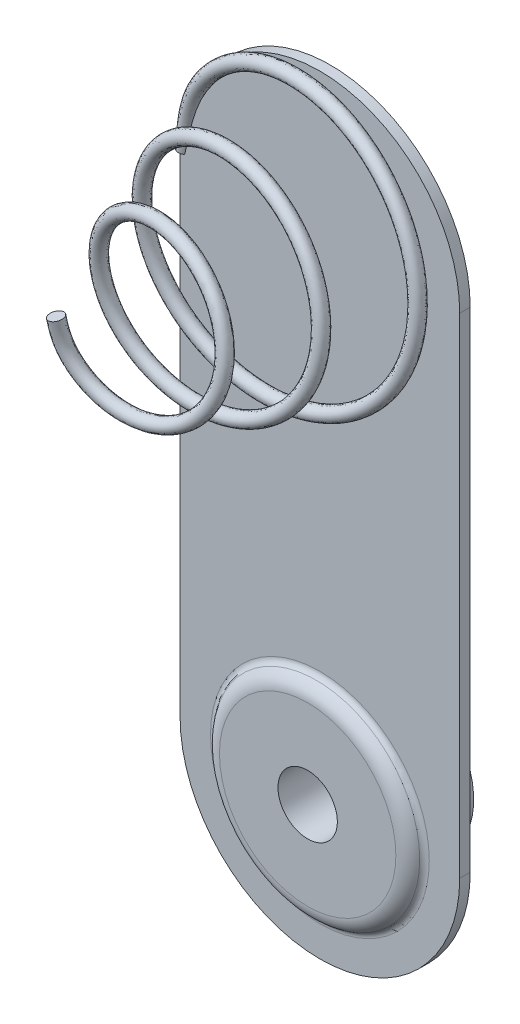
ISO-10303-21;
HEADER;
FILE_DESCRIPTION(('STEP AP214'),'2;1');
FILE_NAME('part.step','',(''),(''),'','','');
FILE_SCHEMA(('AUTOMOTIVE_DESIGN { 1 0 10303 214 1 1 1 1 }'));
ENDSEC;
DATA;
#1=APPLICATION_CONTEXT('core data for automotive mechanical design processes');
#2=APPLICATION_PROTOCOL_DEFINITION('international standard','automotive_design',2000,#1);
#3=PRODUCT_CONTEXT('',#1,'mechanical');
#4=PRODUCT('Part','Part','',(#3));
#5=PRODUCT_RELATED_PRODUCT_CATEGORY('part','',(#4));
#6=PRODUCT_DEFINITION_FORMATION('','',#4);
#7=PRODUCT_DEFINITION_CONTEXT('part definition',#1,'design');
#8=PRODUCT_DEFINITION('design','',#6,#7);
#9=PRODUCT_DEFINITION_SHAPE('','',#8);
#10=(LENGTH_UNIT() NAMED_UNIT(*) SI_UNIT(.MILLI.,.METRE.));
#11=(NAMED_UNIT(*) PLANE_ANGLE_UNIT() SI_UNIT($,.RADIAN.));
#12=(NAMED_UNIT(*) SI_UNIT($,.STERADIAN.) SOLID_ANGLE_UNIT());
#13=UNCERTAINTY_MEASURE_WITH_UNIT(LENGTH_MEASURE(1.E-05),#10,'distance_accuracy_value','');
#14=(GEOMETRIC_REPRESENTATION_CONTEXT(3) GLOBAL_UNCERTAINTY_ASSIGNED_CONTEXT((#13)) GLOBAL_UNIT_ASSIGNED_CONTEXT((#10,
#11,#12)) REPRESENTATION_CONTEXT('',''));
#15=CARTESIAN_POINT('',(0.,0.,0.));
#16=DIRECTION('',(0.,0.,1.));
#17=DIRECTION('',(1.,0.,0.));
#18=AXIS2_PLACEMENT_3D('',#15,#16,#17);
#19=CARTESIAN_POINT('',(0.,-14.,-2.));
#20=DIRECTION('',(0.,0.,1.));
#21=DIRECTION('',(1.,0.,0.));
#22=AXIS2_PLACEMENT_3D('',#19,#20,#21);
#23=CYLINDRICAL_SURFACE('',#22,1.);
#24=CARTESIAN_POINT('',(0.,-14.,-0.15));
#25=DIRECTION('',(0.,0.,1.));
#26=DIRECTION('',(1.,0.,0.));
#27=AXIS2_PLACEMENT_3D('',#24,#25,#26);
#28=CIRCLE('',#27,1.);
#29=CARTESIAN_POINT('',(1.,-14.,-0.15));
#30=VERTEX_POINT('',#29);
#31=EDGE_CURVE('E207',#30,#30,#28,.T.);
#32=ORIENTED_EDGE('',*,*,#31,.F.);
#33=EDGE_LOOP('',(#32));
#34=FACE_BOUND('',#33,.T.);
#35=CARTESIAN_POINT('',(0.,-14.,-1.8));
#36=DIRECTION('',(0.,0.,-1.));
#37=DIRECTION('',(-1.,0.,0.));
#38=AXIS2_PLACEMENT_3D('',#35,#36,#37);
#39=CIRCLE('',#38,1.);
#40=CARTESIAN_POINT('',(-1.,-14.,-1.8));
#41=VERTEX_POINT('',#40);
#42=EDGE_CURVE('E41',#41,#41,#39,.F.);
#43=ORIENTED_EDGE('',*,*,#42,.T.);
#44=EDGE_LOOP('',(#43));
#45=FACE_BOUND('',#44,.T.);
#46=ADVANCED_FACE('F37',(#34,#45),#23,.T.);
#47=CARTESIAN_POINT('',(-1.69681578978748,0.,5.99999999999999));
#48=DIRECTION('',(-0.190719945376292,0.975695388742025,0.107909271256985));
#49=DIRECTION('',(0.0461119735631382,-0.100901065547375,0.99382727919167));
#50=AXIS2_PLACEMENT_3D('',#47,#48,#49);
#51=PLANE('',#50);
#52=CARTESIAN_POINT('',(-1.69681578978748,0.,5.99999999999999));
#53=DIRECTION('',(-0.190719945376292,0.975695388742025,0.107909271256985));
#54=DIRECTION('',(0.0461119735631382,-0.100901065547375,0.99382727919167));
#55=AXIS2_PLACEMENT_3D('',#52,#53,#54);
#56=CIRCLE('',#55,0.2);
#57=CARTESIAN_POINT('',(-1.68759339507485,-0.0201802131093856,6.19876545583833));
#58=VERTEX_POINT('',#57);
#59=EDGE_CURVE('E99',#58,#58,#56,.T.);
#60=ORIENTED_EDGE('',*,*,#59,.T.);
#61=EDGE_LOOP('',(#60));
#62=FACE_BOUND('',#61,.T.);
#63=ADVANCED_FACE('F166',(#62),#51,.T.);
#64=CARTESIAN_POINT('',(-4.,0.,0.));
#65=DIRECTION('',(0.,1.,0.));
#66=DIRECTION('',(0.,0.,1.));
#67=AXIS2_PLACEMENT_3D('',#64,#65,#66);
#68=PLANE('',#67);
#69=DIRECTION('',(0.,0.,-1.));
#70=VECTOR('',#69,1.);
#71=CARTESIAN_POINT('',(-4.,0.,0.15));
#72=LINE('',#71,#70);
#73=CARTESIAN_POINT('',(-4.,0.,0.15));
#74=VERTEX_POINT('',#73);
#75=CARTESIAN_POINT('',(-4.,0.,-0.15));
#76=VERTEX_POINT('',#75);
#77=EDGE_CURVE('E104',#74,#76,#72,.T.);
#78=ORIENTED_EDGE('',*,*,#77,.F.);
#79=DIRECTION('',(1.,0.,0.));
#80=VECTOR('',#79,1.);
#81=CARTESIAN_POINT('',(-4.,0.,0.15));
#82=LINE('',#81,#80);
#83=CARTESIAN_POINT('',(-3.86771243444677,0.,0.15));
#84=VERTEX_POINT('',#83);
#85=EDGE_CURVE('E90',#74,#84,#82,.T.);
#86=ORIENTED_EDGE('',*,*,#85,.T.);
#87=CARTESIAN_POINT('',(-4.,0.,0.));
#88=DIRECTION('',(0.,1.,0.));
#89=DIRECTION('',(0.,0.,1.));
#90=AXIS2_PLACEMENT_3D('',#87,#88,#89);
#91=CIRCLE('',#90,0.2);
#92=CARTESIAN_POINT('',(-3.86771243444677,0.,-0.15));
#93=VERTEX_POINT('',#92);
#94=EDGE_CURVE('E118',#93,#84,#91,.T.);
#95=ORIENTED_EDGE('',*,*,#94,.F.);
#96=DIRECTION('',(1.,0.,0.));
#97=VECTOR('',#96,1.);
#98=CARTESIAN_POINT('',(-4.,0.,-0.15));
#99=LINE('',#98,#97);
#100=EDGE_CURVE('E54',#76,#93,#99,.T.);
#101=ORIENTED_EDGE('',*,*,#100,.F.);
#102=EDGE_LOOP('',(#78,#86,#95,#101));
#103=FACE_BOUND('',#102,.T.);
#104=ADVANCED_FACE('F111',(#103),#68,.F.);
#105=CARTESIAN_POINT('',(-4.,0.,0.2));
#106=CARTESIAN_POINT('',(-3.95955414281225,0.278530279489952,0.22231873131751));
#107=CARTESIAN_POINT('',(-3.88019416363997,0.831714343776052,0.266636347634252));
#108=CARTESIAN_POINT('',(-3.63186594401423,1.63967999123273,0.33515891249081));
#109=CARTESIAN_POINT('',(-3.17585543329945,2.35401811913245,0.403186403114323));
#110=CARTESIAN_POINT('',(-2.57881752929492,2.95453459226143,0.471251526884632));
#111=CARTESIAN_POINT('',(-1.86945368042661,3.41853640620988,0.540499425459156));
#112=CARTESIAN_POINT('',(-1.07763703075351,3.7169636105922,0.610139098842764));
#113=CARTESIAN_POINT('',(-0.239708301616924,3.83635074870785,0.680021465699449));
#114=CARTESIAN_POINT('',(0.604434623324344,3.76840666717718,0.750499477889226));
#115=CARTESIAN_POINT('',(1.41293679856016,3.51674324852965,0.821507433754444));
#116=CARTESIAN_POINT('',(2.14482614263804,3.09100035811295,0.892996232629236));
#117=CARTESIAN_POINT('',(2.76357270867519,2.51298302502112,0.96502426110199));
#118=CARTESIAN_POINT('',(3.22775405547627,1.82173380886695,1.03635330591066));
#119=CARTESIAN_POINT('',(3.52203069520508,1.05905829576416,1.1069765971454));
#120=CARTESIAN_POINT('',(3.64188736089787,0.264691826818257,1.17685270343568));
#121=CARTESIAN_POINT('',(3.58434158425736,-0.536572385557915,1.24726413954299));
#122=CARTESIAN_POINT('',(3.3524923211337,-1.30575421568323,1.31819259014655));
#123=CARTESIAN_POINT('',(2.95473931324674,-2.00378317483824,1.38966023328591));
#124=CARTESIAN_POINT('',(2.41158475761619,-2.59572883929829,1.4616931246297));
#125=CARTESIAN_POINT('',(1.74856085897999,-3.04955487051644,1.53426884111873));
#126=CARTESIAN_POINT('',(0.999871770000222,-3.34100716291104,1.60745051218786));
#127=CARTESIAN_POINT('',(0.204299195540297,-3.4536226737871,1.68120053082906));
#128=CARTESIAN_POINT('',(-0.595715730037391,-3.37885024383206,1.75557237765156));
#129=CARTESIAN_POINT('',(-1.35663811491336,-3.12074226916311,1.83056704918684));
#130=CARTESIAN_POINT('',(-2.03548153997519,-2.69069885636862,1.90618545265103));
#131=CARTESIAN_POINT('',(-2.59341536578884,-2.11243398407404,1.9824822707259));
#132=CARTESIAN_POINT('',(-2.99752872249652,-1.41778085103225,2.05943085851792));
#133=CARTESIAN_POINT('',(-3.22190496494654,-0.646127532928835,2.13707338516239));
#134=CARTESIAN_POINT('',(-3.25161239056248,0.127464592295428,2.21256402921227));
#135=CARTESIAN_POINT('',(-3.10699729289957,0.855979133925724,2.28571262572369));
#136=CARTESIAN_POINT('',(-2.81761493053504,1.50790160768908,2.35658192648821));
#137=CARTESIAN_POINT('',(-2.39099870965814,2.07952927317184,2.42802660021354));
#138=CARTESIAN_POINT('',(-1.84686186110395,2.54069240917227,2.50011159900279));
#139=CARTESIAN_POINT('',(-1.21301058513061,2.86777358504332,2.57282750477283));
#140=CARTESIAN_POINT('',(-0.521108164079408,3.04122326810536,2.64619065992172));
#141=CARTESIAN_POINT('',(0.192083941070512,3.05151550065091,2.72024628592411));
#142=CARTESIAN_POINT('',(0.888273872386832,2.89605399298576,2.79496729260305));
#143=CARTESIAN_POINT('',(1.52858106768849,2.58171231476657,2.87042224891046));
#144=CARTESIAN_POINT('',(2.07688154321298,2.12543639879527,2.94659753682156));
#145=CARTESIAN_POINT('',(2.50009608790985,1.55117355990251,3.02352034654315));
#146=CARTESIAN_POINT('',(2.77279333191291,0.892036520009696,3.10123988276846));
#147=CARTESIAN_POINT('',(2.87713019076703,0.186353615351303,3.17973051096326));
#148=CARTESIAN_POINT('',(2.80692690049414,-0.49726270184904,3.25615512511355));
#149=CARTESIAN_POINT('',(2.58805098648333,-1.11904809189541,3.3303312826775));
#150=CARTESIAN_POINT('',(2.24949422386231,-1.65401623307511,3.40224583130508));
#151=CARTESIAN_POINT('',(1.79919582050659,-2.09892721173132,3.47489438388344));
#152=CARTESIAN_POINT('',(1.2594785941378,-2.42976811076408,3.54825053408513));
#153=CARTESIAN_POINT('',(0.658030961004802,-2.6272073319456,3.62238413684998));
#154=CARTESIAN_POINT('',(0.0272463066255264,-2.68003573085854,3.69728969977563));
#155=CARTESIAN_POINT('',(-0.598271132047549,-2.58284850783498,3.77299294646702));
#156=CARTESIAN_POINT('',(-1.18288773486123,-2.34022520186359,3.84954880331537));
#157=CARTESIAN_POINT('',(-1.69234220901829,-1.96455269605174,3.9269397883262));
#158=CARTESIAN_POINT('',(-2.0951408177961,-1.47627936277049,4.00523504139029));
#159=CARTESIAN_POINT('',(-2.36618506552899,-0.904334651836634,4.08445252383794));
#160=CARTESIAN_POINT('',(-2.48668149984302,-0.282956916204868,4.16460469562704));
#161=CARTESIAN_POINT('',(-2.44705540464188,0.34874042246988,4.24576909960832));
#162=CARTESIAN_POINT('',(-2.24852248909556,0.949592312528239,4.32793691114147));
#163=CARTESIAN_POINT('',(-1.93033490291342,1.43531523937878,4.4042982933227));
#164=CARTESIAN_POINT('',(-1.54979578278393,1.79689934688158,4.47442894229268));
#165=CARTESIAN_POINT('',(-1.14937720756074,2.04834591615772,4.53822010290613));
#166=CARTESIAN_POINT('',(-0.70662807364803,2.21405008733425,4.60269570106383));
#167=CARTESIAN_POINT('',(-0.23960559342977,2.28696946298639,4.66782485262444));
#168=CARTESIAN_POINT('',(0.232399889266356,2.26230722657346,4.73368666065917));
#169=CARTESIAN_POINT('',(0.68912488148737,2.14096549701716,4.8002500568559));
#170=CARTESIAN_POINT('',(1.11009509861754,1.92630368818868,4.86758587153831));
#171=CARTESIAN_POINT('',(1.47634963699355,1.62787147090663,4.93568569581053));
#172=CARTESIAN_POINT('',(1.76987626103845,1.25770088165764,5.00459422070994));
#173=CARTESIAN_POINT('',(1.97645661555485,0.83295702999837,5.07434448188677));
#174=CARTESIAN_POINT('',(2.08484953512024,0.373315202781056,5.14493689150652));
#175=CARTESIAN_POINT('',(2.08828640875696,-0.0815187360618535,5.21383128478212));
#176=CARTESIAN_POINT('',(1.99896994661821,-0.508696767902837,5.28081616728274));
#177=CARTESIAN_POINT('',(1.83174079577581,-0.892925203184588,5.34594136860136));
#178=CARTESIAN_POINT('',(1.58967030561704,-1.23482790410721,5.41181809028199));
#179=CARTESIAN_POINT('',(1.28172852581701,-1.51878461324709,5.47854763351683));
#180=CARTESIAN_POINT('',(0.921425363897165,-1.73211665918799,5.54608733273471));
#181=CARTESIAN_POINT('',(0.523884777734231,-1.86350543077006,5.61455451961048));
#182=CARTESIAN_POINT('',(0.107425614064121,-1.9062563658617,5.68394297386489));
#183=CARTESIAN_POINT('',(-0.308113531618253,-1.85744169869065,5.75418312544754));
#184=CARTESIAN_POINT('',(-0.702761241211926,-1.71905175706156,5.82544460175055));
#185=CARTESIAN_POINT('',(-1.05384131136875,-1.49083706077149,5.89815976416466));
#186=CARTESIAN_POINT('',(-1.34684599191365,-1.19313319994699,5.97139603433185));
#187=CARTESIAN_POINT('',(-1.57409379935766,-0.840994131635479,6.0450490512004));
#188=CARTESIAN_POINT('',(-1.67196014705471,-0.433928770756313,6.12242305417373));
#189=CARTESIAN_POINT('',(-1.68138576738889,-0.158676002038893,6.17320315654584));
#190=CARTESIAN_POINT('',(-1.68759339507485,-0.0201802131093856,6.19876545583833));
#191=CARTESIAN_POINT('',(-3.6,0.,0.2));
#192=CARTESIAN_POINT('',(-3.55951483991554,0.278800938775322,0.222340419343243));
#193=CARTESIAN_POINT('',(-3.47849824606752,0.816170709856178,0.265779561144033));
#194=CARTESIAN_POINT('',(-3.24385775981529,1.52418171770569,0.3251039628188));
#195=CARTESIAN_POINT('',(-2.8299265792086,2.14690012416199,0.395710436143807));
#196=CARTESIAN_POINT('',(-2.28147475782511,2.68305671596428,0.467385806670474));
#197=CARTESIAN_POINT('',(-1.63562609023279,3.08999739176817,0.534510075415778));
#198=CARTESIAN_POINT('',(-0.922714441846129,3.34471341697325,0.603503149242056));
#199=CARTESIAN_POINT('',(-0.168582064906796,3.43949322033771,0.674353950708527));
#200=CARTESIAN_POINT('',(0.585833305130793,3.36552080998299,0.744727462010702));
#201=CARTESIAN_POINT('',(1.30592116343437,3.12793259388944,0.815529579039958));
#202=CARTESIAN_POINT('',(1.95384209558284,2.73565748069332,0.88735235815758));
#203=CARTESIAN_POINT('',(2.4972567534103,2.21000690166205,0.959155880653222));
#204=CARTESIAN_POINT('',(2.90127295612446,1.58493039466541,1.03085118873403));
#205=CARTESIAN_POINT('',(3.15115608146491,0.900959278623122,1.10124479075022));
#206=CARTESIAN_POINT('',(3.24561741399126,0.190235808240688,1.17140195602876));
#207=CARTESIAN_POINT('',(3.18133068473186,-0.521321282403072,1.24174615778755));
#208=CARTESIAN_POINT('',(2.96272341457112,-1.20225425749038,1.31270041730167));
#209=CARTESIAN_POINT('',(2.59778063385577,-1.81581585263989,1.38438833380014));
#210=CARTESIAN_POINT('',(2.10626186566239,-2.33210199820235,1.45619730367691));
#211=CARTESIAN_POINT('',(1.51012483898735,-2.72403536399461,1.52917377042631));
#212=CARTESIAN_POINT('',(0.842837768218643,-2.96926911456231,1.60213166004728));
#213=CARTESIAN_POINT('',(0.13603059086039,-3.05587189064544,1.67613218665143));
#214=CARTESIAN_POINT('',(-0.569346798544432,-2.97599211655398,1.75055547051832));
#215=CARTESIAN_POINT('',(-1.23681777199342,-2.7352604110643,1.8254023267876));
#216=CARTESIAN_POINT('',(-1.82859039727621,-2.34389968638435,1.90142199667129));
#217=CARTESIAN_POINT('',(-2.30939562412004,-1.82530910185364,1.97751058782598));
#218=CARTESIAN_POINT('',(-2.65337081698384,-1.2064064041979,2.05468284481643));
#219=CARTESIAN_POINT('',(-2.83655323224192,-0.524534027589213,2.13246154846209));
#220=CARTESIAN_POINT('',(-2.84893327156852,0.154525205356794,2.20774741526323));
#221=CARTESIAN_POINT('',(-2.70891302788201,0.791373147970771,2.28133895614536));
#222=CARTESIAN_POINT('',(-2.44400151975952,1.35595715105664,2.3519619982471));
#223=CARTESIAN_POINT('',(-2.06005946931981,1.84891216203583,2.42371742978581));
#224=CARTESIAN_POINT('',(-1.57672945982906,2.24096902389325,2.49580851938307));
#225=CARTESIAN_POINT('',(-1.01761838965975,2.51477939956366,2.56843391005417));
#226=CARTESIAN_POINT('',(-0.411490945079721,2.65276312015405,2.642205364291));
#227=CARTESIAN_POINT('',(0.208382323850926,2.64822348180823,2.71597745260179));
#228=CARTESIAN_POINT('',(0.811053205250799,2.49979634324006,2.79113188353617));
#229=CARTESIAN_POINT('',(1.35953040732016,2.21496764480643,2.86651374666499));
#230=CARTESIAN_POINT('',(1.82593219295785,1.80906620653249,2.94266192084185));
#231=CARTESIAN_POINT('',(2.1805416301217,1.30398394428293,3.01999530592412));
#232=CARTESIAN_POINT('',(2.40260899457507,0.730199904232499,3.09747919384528));
#233=CARTESIAN_POINT('',(2.47867560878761,0.119104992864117,3.17630547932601));
#234=CARTESIAN_POINT('',(2.40424286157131,-0.46714882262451,3.2528736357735));
#235=CARTESIAN_POINT('',(2.20373007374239,-0.996657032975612,3.32680913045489));
#236=CARTESIAN_POINT('',(1.90206368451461,-1.44884796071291,3.39928886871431));
#237=CARTESIAN_POINT('',(1.50787958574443,-1.81972156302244,3.47161502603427));
#238=CARTESIAN_POINT('',(1.03895273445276,-2.09176316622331,3.54542504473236));
#239=CARTESIAN_POINT('',(0.522360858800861,-2.24696990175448,3.61954740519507));
#240=CARTESIAN_POINT('',(-0.016204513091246,-2.27867871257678,3.69436501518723));
#241=CARTESIAN_POINT('',(-0.545830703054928,-2.1823768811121,3.7705960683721));
#242=CARTESIAN_POINT('',(-1.0357306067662,-1.96407689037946,3.84686566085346));
#243=CARTESIAN_POINT('',(-1.45942783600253,-1.63446298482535,3.92469247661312));
#244=CARTESIAN_POINT('',(-1.78820114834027,-1.21332281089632,4.00310752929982));
#245=CARTESIAN_POINT('',(-2.0037757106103,-0.725418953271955,4.08213088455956));
#246=CARTESIAN_POINT('',(-2.09104643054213,-0.199591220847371,4.16287007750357));
#247=CARTESIAN_POINT('',(-2.04307195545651,0.328697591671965,4.24402831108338));
#248=CARTESIAN_POINT('',(-1.86309097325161,0.826932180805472,4.32603322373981));
#249=CARTESIAN_POINT('',(-1.58568499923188,1.22518767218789,4.40313891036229));
#250=CARTESIAN_POINT('',(-1.26089441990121,1.51642716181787,4.47286372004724));
#251=CARTESIAN_POINT('',(-0.92141780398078,1.71633088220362,4.53732322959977));
#252=CARTESIAN_POINT('',(-0.551298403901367,1.84242155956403,4.60142449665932));
#253=CARTESIAN_POINT('',(-0.162219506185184,1.89162202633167,4.66718351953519));
#254=CARTESIAN_POINT('',(0.225590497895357,1.85944879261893,4.73278313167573));
#255=CARTESIAN_POINT('',(0.59955544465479,1.74807513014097,4.79982608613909));
#256=CARTESIAN_POINT('',(0.938872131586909,1.56141526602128,4.86714083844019));
#257=CARTESIAN_POINT('',(1.23194056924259,1.30732321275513,4.9353972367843));
#258=CARTESIAN_POINT('',(1.46164388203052,0.997720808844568,5.00472025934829));
#259=CARTESIAN_POINT('',(1.61902493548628,0.646294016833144,5.07407040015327));
#260=CARTESIAN_POINT('',(1.69490395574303,0.269981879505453,5.14561626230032));
#261=CARTESIAN_POINT('',(1.68556260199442,-0.0977303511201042,5.21395442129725));
#262=CARTESIAN_POINT('',(1.60190934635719,-0.440941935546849,5.28188340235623));
#263=CARTESIAN_POINT('',(1.45713219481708,-0.744755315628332,5.34649300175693));
#264=CARTESIAN_POINT('',(1.25309844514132,-1.01330146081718,5.41324016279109));
#265=CARTESIAN_POINT('',(0.999581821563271,-1.23102862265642,5.47957722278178));
#266=CARTESIAN_POINT('',(0.705611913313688,-1.39169290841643,5.54794103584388));
#267=CARTESIAN_POINT('',(0.386918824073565,-1.4843036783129,5.61628422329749));
#268=CARTESIAN_POINT('',(0.0552941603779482,-1.50642343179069,5.68536293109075));
#269=CARTESIAN_POINT('',(-0.27049771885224,-1.4558204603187,5.75680169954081));
#270=CARTESIAN_POINT('',(-0.57583287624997,-1.33601367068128,5.83005382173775));
#271=CARTESIAN_POINT('',(-0.843179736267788,-1.14691123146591,5.89790568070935));
#272=CARTESIAN_POINT('',(-1.06757017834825,-0.902397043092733,5.97248945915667));
#273=CARTESIAN_POINT('',(-1.22890261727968,-0.627052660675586,6.05895592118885));
#274=CARTESIAN_POINT('',(-1.28050659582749,-0.335986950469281,6.11647968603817));
#275=CARTESIAN_POINT('',(-1.28914787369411,-0.0811709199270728,6.16284839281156));
#276=CARTESIAN_POINT('',(-1.2953690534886,0.0576272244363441,6.18846649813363));
#277=CARTESIAN_POINT('',(-3.6,0.,-0.2));
#278=CARTESIAN_POINT('',(-3.55951483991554,0.278800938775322,-0.177659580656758));
#279=CARTESIAN_POINT('',(-3.47949589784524,0.81633197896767,-0.134242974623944));
#280=CARTESIAN_POINT('',(-3.25303768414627,1.52906590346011,-0.0747781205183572));
#281=CARTESIAN_POINT('',(-2.83536203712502,2.15240526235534,-0.00421849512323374));
#282=CARTESIAN_POINT('',(-2.28339906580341,2.68676146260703,0.067403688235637));
#283=CARTESIAN_POINT('',(-1.63747736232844,3.09613944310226,0.134560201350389));
#284=CARTESIAN_POINT('',(-0.923046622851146,3.35182718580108,0.203565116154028));
#285=CARTESIAN_POINT('',(-0.167133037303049,3.44556976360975,0.274401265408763));
#286=CARTESIAN_POINT('',(0.58881070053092,3.37123409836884,0.344778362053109));
#287=CARTESIAN_POINT('',(1.31046355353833,3.13294864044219,0.415585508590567));
#288=CARTESIAN_POINT('',(1.95937758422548,2.7391692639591,0.487404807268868));
#289=CARTESIAN_POINT('',(2.50381802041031,2.21214036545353,0.559214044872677));
#290=CARTESIAN_POINT('',(2.90796705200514,1.58518694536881,0.630905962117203));
#291=CARTESIAN_POINT('',(3.15805455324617,0.899552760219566,0.701305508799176));
#292=CARTESIAN_POINT('',(3.25182027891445,0.187078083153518,0.771461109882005));
#293=CARTESIAN_POINT('',(3.18674217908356,-0.526012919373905,0.841809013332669));
#294=CARTESIAN_POINT('',(2.96685963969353,-1.20831880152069,0.912766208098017));
#295=CARTESIAN_POINT('',(2.60017475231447,-1.82273315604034,0.984453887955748));
#296=CARTESIAN_POINT('',(2.10697385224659,-2.33978571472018,1.05627005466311));
#297=CARTESIAN_POINT('',(1.50867308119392,-2.73149880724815,1.1292442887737));
#298=CARTESIAN_POINT('',(0.839506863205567,-2.9765259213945,1.20220969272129));
#299=CARTESIAN_POINT('',(0.130782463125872,-3.06198210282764,1.27621120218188));
#300=CARTESIAN_POINT('',(-0.576124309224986,-2.98065059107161,1.35063830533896));
#301=CARTESIAN_POINT('',(-1.2449118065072,-2.7382255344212,1.42549289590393));
#302=CARTESIAN_POINT('',(-1.83717219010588,-2.34441018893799,1.50151208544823));
#303=CARTESIAN_POINT('',(-2.31824660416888,-1.82365359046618,1.57760974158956));
#304=CARTESIAN_POINT('',(-2.66157042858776,-1.20226115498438,1.65478548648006));
#305=CARTESIAN_POINT('',(-2.84346628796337,-0.518217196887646,1.73256881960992));
#306=CARTESIAN_POINT('',(-2.85437526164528,0.162700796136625,1.80786511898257));
#307=CARTESIAN_POINT('',(-2.71188299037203,0.800758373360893,1.88145759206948));
#308=CARTESIAN_POINT('',(-2.44489216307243,1.36619605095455,1.95209159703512));
#309=CARTESIAN_POINT('',(-2.05821248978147,1.85920356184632,2.02385098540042));
#310=CARTESIAN_POINT('',(-1.57237279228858,2.25077924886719,2.0959500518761));
#311=CARTESIAN_POINT('',(-1.01081020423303,2.52363906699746,2.16858643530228));
#312=CARTESIAN_POINT('',(-0.402451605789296,2.65952458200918,2.24236135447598));
#313=CARTESIAN_POINT('',(0.219173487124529,2.65299789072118,2.31614795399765));
#314=CARTESIAN_POINT('',(0.822937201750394,2.50145298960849,2.39130751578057));
#315=CARTESIAN_POINT('',(1.37183688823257,2.21367831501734,2.4667016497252));
#316=CARTESIAN_POINT('',(1.83798763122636,1.80461146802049,2.54286337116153));
#317=CARTESIAN_POINT('',(2.19107109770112,1.29624765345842,2.62020394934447));
#318=CARTESIAN_POINT('',(2.41134687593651,0.719786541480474,2.69770530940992));
#319=CARTESIAN_POINT('',(2.48436760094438,0.10635677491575,2.77654271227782));
#320=CARTESIAN_POINT('',(2.40655204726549,-0.481234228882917,2.85312381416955));
#321=CARTESIAN_POINT('',(2.20276538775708,-1.01147510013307,2.9270791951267));
#322=CARTESIAN_POINT('',(1.89715315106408,-1.46309816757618,2.99956728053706));
#323=CARTESIAN_POINT('',(1.49972522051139,-1.83305676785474,3.07191491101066));
#324=CARTESIAN_POINT('',(1.02734839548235,-2.10277660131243,3.14573789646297));
#325=CARTESIAN_POINT('',(0.508109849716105,-2.25513805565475,3.21987899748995));
#326=CARTESIAN_POINT('',(-0.0325537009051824,-2.28345081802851,3.29471953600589));
#327=CARTESIAN_POINT('',(-0.563194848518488,-2.18258605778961,3.37096517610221));
#328=CARTESIAN_POINT('',(-1.05328246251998,-1.96016416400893,3.44726192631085));
#329=CARTESIAN_POINT('',(-1.47574059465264,-1.6257786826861,3.52510906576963));
#330=CARTESIAN_POINT('',(-1.8021237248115,-1.20045227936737,3.60354833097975));
#331=CARTESIAN_POINT('',(-2.01456393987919,-0.708972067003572,3.68260338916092));
#332=CARTESIAN_POINT('',(-2.09694863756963,-0.180299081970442,3.76336601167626));
#333=CARTESIAN_POINT('',(-2.04386880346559,0.349432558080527,3.84455613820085));
#334=CARTESIAN_POINT('',(-1.85845729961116,0.847990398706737,3.92659898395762));
#335=CARTESIAN_POINT('',(-1.57532420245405,1.24453168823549,4.00373016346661));
#336=CARTESIAN_POINT('',(-1.24635507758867,1.53370503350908,4.07349232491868));
#337=CARTESIAN_POINT('',(-0.902984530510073,1.73013250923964,4.13797669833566));
#338=CARTESIAN_POINT('',(-0.530008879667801,1.85274141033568,4.20211448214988));
#339=CARTESIAN_POINT('',(-0.138634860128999,1.89694063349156,4.26790322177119));
#340=CARTESIAN_POINT('',(0.250387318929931,1.85997815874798,4.33354138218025));
#341=CARTESIAN_POINT('',(0.62443835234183,1.74288462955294,4.40062081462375));
#342=CARTESIAN_POINT('',(0.962634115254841,1.55081389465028,4.4679753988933));
#343=CARTESIAN_POINT('',(1.25342327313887,1.29136056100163,4.53627731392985));
#344=CARTESIAN_POINT('',(1.47921343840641,0.976787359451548,4.60564078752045));
#345=CARTESIAN_POINT('',(1.63236309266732,0.62144198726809,4.6750475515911));
#346=CARTESIAN_POINT('',(1.70168286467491,0.241990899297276,4.74663592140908));
#347=CARTESIAN_POINT('',(1.68667277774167,-0.127339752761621,4.81503490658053));
#348=CARTESIAN_POINT('',(1.59582381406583,-0.470571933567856,4.88301153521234));
#349=CARTESIAN_POINT('',(1.44523706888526,-0.773441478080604,4.94768229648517));
#350=CARTESIAN_POINT('',(1.23450336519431,-1.03906487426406,5.01448390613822));
#351=CARTESIAN_POINT('',(0.975635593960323,-1.25313249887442,5.08088640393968));
#352=CARTESIAN_POINT('',(0.676454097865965,-1.40804440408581,5.14931535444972));
#353=CARTESIAN_POINT('',(0.354193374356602,-1.49434821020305,5.21773170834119));
#354=CARTESIAN_POINT('',(0.0202132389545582,-1.50962800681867,5.2868911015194));
#355=CARTESIAN_POINT('',(-0.306149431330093,-1.44988024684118,5.358392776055));
#356=CARTESIAN_POINT('',(-0.6093546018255,-1.32014698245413,5.43175038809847));
#357=CARTESIAN_POINT('',(-0.875993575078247,-1.12726377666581,5.49974993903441));
#358=CARTESIAN_POINT('',(-1.09500130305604,-0.874266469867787,5.57426740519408));
#359=CARTESIAN_POINT('',(-1.23789532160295,-0.586870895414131,5.66099361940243));
#360=CARTESIAN_POINT('',(-1.29669462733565,-0.296221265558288,5.71879500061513));
#361=CARTESIAN_POINT('',(-1.30759266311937,-0.0408104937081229,5.7653174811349));
#362=CARTESIAN_POINT('',(-1.31381384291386,0.0979876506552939,5.79093558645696));
#363=CARTESIAN_POINT('',(-4.,0.,-0.2));
#364=CARTESIAN_POINT('',(-3.9595344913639,0.278665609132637,-0.177670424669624));
#365=CARTESIAN_POINT('',(-3.88120079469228,0.831813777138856,-0.133391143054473));
#366=CARTESIAN_POINT('',(-3.64104345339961,1.64458080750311,-0.0647218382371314));
#367=CARTESIAN_POINT('',(-3.18129154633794,2.35951874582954,0.0032571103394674));
#368=CARTESIAN_POINT('',(-2.58074166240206,2.95824054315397,0.0712695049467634));
#369=CARTESIAN_POINT('',(-1.87130499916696,3.4246781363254,0.140549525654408));
#370=CARTESIAN_POINT('',(-1.07796919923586,3.72407746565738,0.210201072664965));
#371=CARTESIAN_POINT('',(-0.238259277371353,3.84242726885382,0.280068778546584));
#372=CARTESIAN_POINT('',(0.607412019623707,3.77411996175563,0.350550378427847));
#373=CARTESIAN_POINT('',(1.41747918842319,3.52175929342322,0.421563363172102));
#374=CARTESIAN_POINT('',(2.15036163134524,3.09451214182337,0.493048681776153));
#375=CARTESIAN_POINT('',(2.77013397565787,2.51511648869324,0.565082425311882));
#376=CARTESIAN_POINT('',(3.23444815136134,1.82199035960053,0.636408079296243));
#377=CARTESIAN_POINT('',(3.5289291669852,1.05765177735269,0.707037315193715));
#378=CARTESIAN_POINT('',(3.64809022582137,0.261534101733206,0.776911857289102));
#379=CARTESIAN_POINT('',(3.58975307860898,-0.541264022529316,0.847326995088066));
#380=CARTESIAN_POINT('',(3.35662854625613,-1.31181875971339,0.918258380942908));
#381=CARTESIAN_POINT('',(2.95713343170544,-2.01070047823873,0.989725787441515));
#382=CARTESIAN_POINT('',(2.41229674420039,-2.60341255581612,1.06176587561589));
#383=CARTESIAN_POINT('',(1.74710910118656,-3.05701831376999,1.13433935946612));
#384=CARTESIAN_POINT('',(0.996540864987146,-3.34826396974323,1.20752854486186));
#385=CARTESIAN_POINT('',(0.19905106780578,-3.4597328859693,1.28127954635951));
#386=CARTESIAN_POINT('',(-0.602493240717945,-3.38350871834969,1.35565521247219));
#387=CARTESIAN_POINT('',(-1.36473214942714,-3.12370739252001,1.43065761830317));
#388=CARTESIAN_POINT('',(-2.04406333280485,-2.69120935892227,1.50627554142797));
#389=CARTESIAN_POINT('',(-2.60226634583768,-2.11077847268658,1.58258142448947));
#390=CARTESIAN_POINT('',(-3.00572833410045,-1.41363560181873,1.65953350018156));
#391=CARTESIAN_POINT('',(-3.22881802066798,-0.639810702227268,1.73718065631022));
#392=CARTESIAN_POINT('',(-3.25705438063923,0.13564018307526,1.81268173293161));
#393=CARTESIAN_POINT('',(-3.10996725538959,0.865364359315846,1.88583126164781));
#394=CARTESIAN_POINT('',(-2.81850557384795,1.51814050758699,1.95671152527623));
#395=CARTESIAN_POINT('',(-2.3891517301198,2.08982067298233,2.02816015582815));
#396=CARTESIAN_POINT('',(-1.84250519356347,2.5505026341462,2.10025313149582));
#397=CARTESIAN_POINT('',(-1.20620239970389,2.87663325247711,2.17298003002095));
#398=CARTESIAN_POINT('',(-0.512068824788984,3.0479847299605,2.24634665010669));
#399=CARTESIAN_POINT('',(0.202875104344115,3.05628990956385,2.32041678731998));
#400=CARTESIAN_POINT('',(0.900157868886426,2.89771063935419,2.39514292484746));
#401=CARTESIAN_POINT('',(1.5408875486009,2.58042298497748,2.47061015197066));
#402=CARTESIAN_POINT('',(2.08893698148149,2.12098166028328,2.54679898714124));
#403=CARTESIAN_POINT('',(2.51062555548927,1.543437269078,2.6237289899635));
#404=CARTESIAN_POINT('',(2.78153121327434,0.881623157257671,2.7014659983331));
#405=CARTESIAN_POINT('',(2.8828221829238,0.173605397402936,2.77996774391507));
#406=CARTESIAN_POINT('',(2.80923608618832,-0.511348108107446,2.8564053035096));
#407=CARTESIAN_POINT('',(2.58708630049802,-1.13386615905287,2.93060134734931));
#408=CARTESIAN_POINT('',(2.24458369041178,-1.66826643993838,3.00252424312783));
#409=CARTESIAN_POINT('',(1.79104145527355,-2.11226241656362,3.07519426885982));
#410=CARTESIAN_POINT('',(1.24787425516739,-2.4407815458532,3.14856338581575));
#411=CARTESIAN_POINT('',(0.643779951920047,-2.63537548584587,3.22271572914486));
#412=CARTESIAN_POINT('',(0.0108971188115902,-2.68480783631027,3.2976442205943));
#413=CARTESIAN_POINT('',(-0.61563527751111,-2.58305768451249,3.37336205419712));
#414=CARTESIAN_POINT('',(-1.20043959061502,-2.33631247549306,3.44994506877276));
#415=CARTESIAN_POINT('',(-1.7086549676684,-1.95586839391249,3.52735637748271));
#416=CARTESIAN_POINT('',(-2.10906339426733,-1.46340883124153,3.60567584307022));
#417=CARTESIAN_POINT('',(-2.37697329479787,-0.887887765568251,3.6849250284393));
#418=CARTESIAN_POINT('',(-2.49258370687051,-0.263664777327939,3.76510062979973));
#419=CARTESIAN_POINT('',(-2.44785225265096,0.369475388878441,3.84629692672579));
#420=CARTESIAN_POINT('',(-2.24388881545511,0.970650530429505,3.92850267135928));
#421=CARTESIAN_POINT('',(-1.91997410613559,1.45465925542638,4.00488954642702));
#422=CARTESIAN_POINT('',(-1.53525644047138,1.81417721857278,4.07505754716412));
#423=CARTESIAN_POINT('',(-1.13094393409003,2.06214754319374,4.13887357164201));
#424=CARTESIAN_POINT('',(-0.685338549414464,2.2243699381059,4.20338568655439));
#425=CARTESIAN_POINT('',(-0.216020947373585,2.29228807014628,4.26854455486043));
#426=CARTESIAN_POINT('',(0.25719671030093,2.26283659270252,4.33444491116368));
#427=CARTESIAN_POINT('',(0.71400778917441,2.13577499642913,4.40104478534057));
#428=CARTESIAN_POINT('',(1.13385708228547,1.91570231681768,4.46842043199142));
#429=CARTESIAN_POINT('',(1.49783234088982,1.61190881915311,4.53656577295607));
#430=CARTESIAN_POINT('',(1.78744581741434,1.23676743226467,4.60551474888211));
#431=CARTESIAN_POINT('',(1.9897947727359,0.808105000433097,4.67532163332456));
#432=CARTESIAN_POINT('',(2.09162844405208,0.345324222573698,4.74595655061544));
#433=CARTESIAN_POINT('',(2.08939658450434,-0.111128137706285,4.81491177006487));
#434=CARTESIAN_POINT('',(1.99288441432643,-0.5383267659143,4.8819443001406));
#435=CARTESIAN_POINT('',(1.81984566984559,-0.921611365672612,4.947130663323));
#436=CARTESIAN_POINT('',(1.57107522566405,-1.26059131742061,5.01306183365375));
#437=CARTESIAN_POINT('',(1.25778229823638,-1.54088848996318,5.0798568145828));
#438=CARTESIAN_POINT('',(0.892267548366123,-1.74846815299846,5.14746165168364));
#439=CARTESIAN_POINT('',(0.491159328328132,-1.87354996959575,5.21600200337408));
#440=CARTESIAN_POINT('',(0.0723446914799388,-1.90946091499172,5.28547114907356));
#441=CARTESIAN_POINT('',(-0.343765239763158,-1.85150158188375,5.35577418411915));
#442=CARTESIAN_POINT('',(-0.736282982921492,-1.70318470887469,5.42714123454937));
#443=CARTESIAN_POINT('',(-1.08665508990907,-1.47119095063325,5.50000377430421));
#444=CARTESIAN_POINT('',(-1.37427734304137,-1.16499757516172,5.57317491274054));
#445=CARTESIAN_POINT('',(-1.58308566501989,-0.800831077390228,5.64708329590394));
#446=CARTESIAN_POINT('',(-1.68815127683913,-0.394093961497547,5.7247511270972));
#447=CARTESIAN_POINT('',(-1.69982378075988,-0.118466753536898,5.77564434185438));
#448=CARTESIAN_POINT('',(-1.70603818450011,0.0201802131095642,5.80123454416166));
#449=CARTESIAN_POINT('',(-4.4,0.,-0.2));
#450=CARTESIAN_POINT('',(-4.35955414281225,0.278530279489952,-0.17768126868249));
#451=CARTESIAN_POINT('',(-4.28290569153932,0.847295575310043,-0.132539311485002));
#452=CARTESIAN_POINT('',(-4.02904922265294,1.76009571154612,-0.0546655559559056));
#453=CARTESIAN_POINT('',(-3.52722105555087,2.56663222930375,0.0107327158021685));
#454=CARTESIAN_POINT('',(-2.87808425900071,3.22971962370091,0.07513532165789));
#455=CARTESIAN_POINT('',(-2.10513263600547,3.75321682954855,0.146538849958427));
#456=CARTESIAN_POINT('',(-1.23289177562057,4.09632774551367,0.216837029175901));
#457=CARTESIAN_POINT('',(-0.309385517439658,4.23928477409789,0.285736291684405));
#458=CARTESIAN_POINT('',(0.626013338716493,4.17700582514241,0.356322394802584));
#459=CARTESIAN_POINT('',(1.52449482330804,3.91056994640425,0.427541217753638));
#460=CARTESIAN_POINT('',(2.34134567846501,3.44985501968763,0.498692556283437));
#461=CARTESIAN_POINT('',(3.03644993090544,2.81809261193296,0.570950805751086));
#462=CARTESIAN_POINT('',(3.56092925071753,2.05879377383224,0.641910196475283));
#463=CARTESIAN_POINT('',(3.89980378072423,1.21575079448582,0.712769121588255));
#464=CARTESIAN_POINT('',(4.04436017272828,0.335990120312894,0.7823626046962));
#465=CARTESIAN_POINT('',(3.99276397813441,-0.556515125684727,0.852844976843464));
#466=CARTESIAN_POINT('',(3.74639745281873,-1.41531871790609,0.9237505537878));
#467=CARTESIAN_POINT('',(3.3140921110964,-2.19866780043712,0.994997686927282));
#468=CARTESIAN_POINT('',(2.7176196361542,-2.86703939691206,1.06726169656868));
#469=CARTESIAN_POINT('',(1.9855451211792,-3.38253782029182,1.13943443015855));
#470=CARTESIAN_POINT('',(1.15357486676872,-3.72000201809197,1.21284739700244));
#471=CARTESIAN_POINT('',(0.267319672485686,-3.85748366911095,1.28634789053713));
#472=CARTESIAN_POINT('',(-0.628862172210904,-3.78636684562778,1.36067211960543));
#473=CARTESIAN_POINT('',(-1.48455249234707,-3.50918925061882,1.43582234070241));
#474=CARTESIAN_POINT('',(-2.25095447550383,-3.03800852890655,1.51103899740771));
#475=CARTESIAN_POINT('',(-2.88628608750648,-2.39790335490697,1.58755310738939));
#476=CARTESIAN_POINT('',(-3.34988623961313,-1.62501004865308,1.66428151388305));
#477=CARTESIAN_POINT('',(-3.6141697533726,-0.76140420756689,1.74179249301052));
#478=CARTESIAN_POINT('',(-3.65973349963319,0.108579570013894,1.81749834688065));
#479=CARTESIAN_POINT('',(-3.50805152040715,0.929970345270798,1.89020493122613));
#480=CARTESIAN_POINT('',(-3.19211898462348,1.67008496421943,1.96133145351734));
#481=CARTESIAN_POINT('',(-2.72009097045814,2.32043778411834,2.03246932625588));
#482=CARTESIAN_POINT('',(-2.11263759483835,2.85022601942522,2.10455621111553));
#483=CARTESIAN_POINT('',(-1.40159459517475,3.22962743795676,2.17737362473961));
#484=CARTESIAN_POINT('',(-0.621686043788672,3.43644487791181,2.25033194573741));
#485=CARTESIAN_POINT('',(0.186576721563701,3.45958192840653,2.32468562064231));
#486=CARTESIAN_POINT('',(0.977378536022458,3.29396828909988,2.39897833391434));
#487=CARTESIAN_POINT('',(1.70993820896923,2.94716765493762,2.47451865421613));
#488=CARTESIAN_POINT('',(2.33988633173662,2.43735185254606,2.55073460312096));
#489=CARTESIAN_POINT('',(2.83018001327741,1.79062688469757,2.62725403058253));
#490=CARTESIAN_POINT('',(3.15171555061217,1.04345977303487,2.70522668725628));
#491=CARTESIAN_POINT('',(3.28127676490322,0.240854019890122,2.78339277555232));
#492=CARTESIAN_POINT('',(3.21192012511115,-0.541461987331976,2.85968679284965));
#493=CARTESIAN_POINT('',(2.97140721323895,-1.25625721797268,2.93412349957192));
#494=CARTESIAN_POINT('',(2.59201422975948,-1.87343471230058,3.0054812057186));
#495=CARTESIAN_POINT('',(2.08235769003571,-2.3914680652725,3.07847362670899));
#496=CARTESIAN_POINT('',(1.46840011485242,-2.77878649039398,3.15138887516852));
#497=CARTESIAN_POINT('',(0.779450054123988,-3.01561291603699,3.22555246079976));
#498=CARTESIAN_POINT('',(0.0543479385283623,-3.08616485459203,3.3005689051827));
#499=CARTESIAN_POINT('',(-0.668075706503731,-2.98352931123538,3.37575893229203));
#500=CARTESIAN_POINT('',(-1.34759671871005,-2.7124607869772,3.45262821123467));
#501=CARTESIAN_POINT('',(-1.94156934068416,-2.28595810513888,3.52960368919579));
#502=CARTESIAN_POINT('',(-2.41600306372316,-1.72636538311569,3.60780335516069));
#503=CARTESIAN_POINT('',(-2.73938264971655,-1.06680346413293,3.68724666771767));
#504=CARTESIAN_POINT('',(-2.88821877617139,-0.347030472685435,3.7668352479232));
#505=CARTESIAN_POINT('',(-2.85183570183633,0.389518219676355,3.84803771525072));
#506=CARTESIAN_POINT('',(-2.62932033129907,1.09331066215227,3.93040635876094));
#507=CARTESIAN_POINT('',(-2.26462400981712,1.66478682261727,4.00604892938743));
#508=CARTESIAN_POINT('',(-1.8241578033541,2.09464940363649,4.07662276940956));
#509=CARTESIAN_POINT('',(-1.35890333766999,2.39416257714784,4.13977044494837));
#510=CARTESIAN_POINT('',(-0.840668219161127,2.59599846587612,4.2046568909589));
#511=CARTESIAN_POINT('',(-0.293407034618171,2.68763550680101,4.26918588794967));
#512=CARTESIAN_POINT('',(0.264006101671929,2.66569502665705,4.33534844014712));
#513=CARTESIAN_POINT('',(0.803577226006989,2.52866536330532,4.40146875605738));
#514=CARTESIAN_POINT('',(1.3050800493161,2.28059073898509,4.46886546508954));
#515=CARTESIAN_POINT('',(1.74224140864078,1.9324570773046,4.53685423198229));
#516=CARTESIAN_POINT('',(2.09567819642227,1.4967475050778,4.60538871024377));
#517=CARTESIAN_POINT('',(2.34722645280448,0.994768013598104,4.67559571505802));
#518=CARTESIAN_POINT('',(2.48157402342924,0.44865754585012,4.7452771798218));
#519=CARTESIAN_POINT('',(2.492120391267,-0.0949165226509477,4.8147886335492));
#520=CARTESIAN_POINT('',(2.38994501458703,-0.606081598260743,4.88087706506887));
#521=CARTESIAN_POINT('',(2.19445427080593,-1.06978125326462,4.94657903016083));
#522=CARTESIAN_POINT('',(1.90764708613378,-1.48211776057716,5.01163976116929));
#523=CARTESIAN_POINT('',(1.53992900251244,-1.82864448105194,5.07882722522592));
#524=CARTESIAN_POINT('',(1.10808099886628,-2.08889190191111,5.14560794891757));
#525=CARTESIAN_POINT('',(0.628125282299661,-2.25275172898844,5.21427229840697));
#526=CARTESIAN_POINT('',(0.12447614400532,-2.30929382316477,5.28405119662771));
#527=CARTESIAN_POINT('',(-0.381381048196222,-2.25312291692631,5.3531555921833));
#528=CARTESIAN_POINT('',(-0.863211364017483,-2.08622243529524,5.42253208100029));
#529=CARTESIAN_POINT('',(-1.2973166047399,-1.8151181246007,5.500257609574));
#530=CARTESIAN_POINT('',(-1.65355338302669,-1.45572868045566,5.57208242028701));
#531=CARTESIAN_POINT('',(-1.92827600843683,-1.01479125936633,5.63317297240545));
#532=CARTESIAN_POINT('',(-2.07960792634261,-0.491966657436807,5.73070725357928));
#533=CARTESIAN_POINT('',(-2.09205489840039,-0.196123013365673,5.78597120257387));
#534=CARTESIAN_POINT('',(-2.09826252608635,-0.0576272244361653,5.81153350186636));
#535=CARTESIAN_POINT('',(-4.4,0.,0.2));
#536=CARTESIAN_POINT('',(-4.35959344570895,0.278259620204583,0.222297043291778));
#537=CARTESIAN_POINT('',(-4.28189008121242,0.847257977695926,0.26749313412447));
#538=CARTESIAN_POINT('',(-4.01987412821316,1.75517826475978,0.34521386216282));
#539=CARTESIAN_POINT('',(-3.52178428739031,2.56113611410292,0.41066237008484));
#540=CARTESIAN_POINT('',(-2.87616030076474,3.22601246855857,0.47511724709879));
#541=CARTESIAN_POINT('',(-2.10328127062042,3.74707542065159,0.546488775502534));
#542=CARTESIAN_POINT('',(-1.2325596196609,4.08921380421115,0.616775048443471));
#543=CARTESIAN_POINT('',(-0.310834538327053,4.233208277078,0.68568898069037));
#544=CARTESIAN_POINT('',(0.623035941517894,4.17129252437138,0.75627149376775));
#545=CARTESIAN_POINT('',(1.51995243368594,3.90555390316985,0.82748528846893));
#546=CARTESIAN_POINT('',(2.33581018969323,3.44634323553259,0.898640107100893));
#547=CARTESIAN_POINT('',(3.02988866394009,2.81595914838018,0.970892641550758));
#548=CARTESIAN_POINT('',(3.55423515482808,2.05853722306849,1.04185542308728));
#549=CARTESIAN_POINT('',(3.89290530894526,1.21715731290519,1.11270840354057));
#550=CARTESIAN_POINT('',(4.03815730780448,0.339147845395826,1.18230345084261));
#551=CARTESIAN_POINT('',(3.98735248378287,-0.551823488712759,1.25278212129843));
#552=CARTESIAN_POINT('',(3.74226122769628,-1.40925417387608,1.32368476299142));
#553=CARTESIAN_POINT('',(3.31169799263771,-2.19175049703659,1.39493213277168));
#554=CARTESIAN_POINT('',(2.71690764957,-2.85935568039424,1.46718894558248));
#555=CARTESIAN_POINT('',(1.98699687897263,-3.37507437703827,1.53936391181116));
#556=CARTESIAN_POINT('',(1.1569057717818,-3.71274521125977,1.61276936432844));
#557=CARTESIAN_POINT('',(0.272567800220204,-3.85137345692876,1.68626887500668));
#558=CARTESIAN_POINT('',(-0.62208466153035,-3.78170837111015,1.76058928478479));
#559=CARTESIAN_POINT('',(-1.4764584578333,-3.50622412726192,1.83573177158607));
#560=CARTESIAN_POINT('',(-2.24237268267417,-3.0374980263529,1.91094890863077));
#561=CARTESIAN_POINT('',(-2.87743510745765,-2.39955886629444,1.98745395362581));
#562=CARTESIAN_POINT('',(-3.34168662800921,-1.6291552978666,2.06417887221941));
#563=CARTESIAN_POINT('',(-3.60725669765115,-0.767721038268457,2.14168522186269));
#564=CARTESIAN_POINT('',(-3.65429150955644,0.100403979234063,2.21738064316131));
#565=CARTESIAN_POINT('',(-3.50508155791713,0.920585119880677,2.29008629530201));
#566=CARTESIAN_POINT('',(-3.19122834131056,1.65984606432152,2.36120185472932));
#567=CARTESIAN_POINT('',(-2.72193794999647,2.31014638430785,2.43233577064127));
#568=CARTESIAN_POINT('',(-2.11699426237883,2.84041579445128,2.5044146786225));
#569=CARTESIAN_POINT('',(-1.40840278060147,3.22076777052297,2.57722109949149));
#570=CARTESIAN_POINT('',(-0.630725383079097,3.42968341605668,2.65017595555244));
#571=CARTESIAN_POINT('',(0.175785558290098,3.45480751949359,2.72451511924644));
#572=CARTESIAN_POINT('',(0.965494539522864,3.29231164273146,2.79880270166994));
#573=CARTESIAN_POINT('',(1.69763172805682,2.94845698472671,2.87433075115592));
#574=CARTESIAN_POINT('',(2.32783089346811,2.44180659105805,2.95053315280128));
#575=CARTESIAN_POINT('',(2.81965054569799,1.79836317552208,3.02704538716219));
#576=CARTESIAN_POINT('',(3.14297766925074,1.05387313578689,3.10500057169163));
#577=CARTESIAN_POINT('',(3.27558477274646,0.253602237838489,3.18315554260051));
#578=CARTESIAN_POINT('',(3.20961093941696,-0.527376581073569,3.2594366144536));
#579=CARTESIAN_POINT('',(2.97237189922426,-1.24143915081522,3.3338534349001));
#580=CARTESIAN_POINT('',(2.59692476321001,-1.85918450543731,3.40520279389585));
#581=CARTESIAN_POINT('',(2.09051205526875,-2.3781328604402,3.4781737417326));
#582=CARTESIAN_POINT('',(1.48000445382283,-2.76777305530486,3.55107602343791));
#583=CARTESIAN_POINT('',(0.793701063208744,-3.00744476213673,3.62522086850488));
#584=CARTESIAN_POINT('',(0.0706971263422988,-3.0813927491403,3.70021438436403));
#585=CARTESIAN_POINT('',(-0.650711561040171,-2.98332013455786,3.77538982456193));
#586=CARTESIAN_POINT('',(-1.33004486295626,-2.71637351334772,3.85223194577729));
#587=CARTESIAN_POINT('',(-1.92525658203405,-2.29464240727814,3.92918710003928));
#588=CARTESIAN_POINT('',(-2.40208048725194,-1.73923591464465,4.00736255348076));
#589=CARTESIAN_POINT('',(-2.72859442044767,-1.08325035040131,4.08677416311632));
#590=CARTESIAN_POINT('',(-2.88231656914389,-0.366322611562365,4.16633931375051));
#591=CARTESIAN_POINT('',(-2.85103885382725,0.368783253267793,4.24750988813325));
#592=CARTESIAN_POINT('',(-2.63395400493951,1.07225244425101,4.32984059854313));
#593=CARTESIAN_POINT('',(-2.27498480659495,1.64544280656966,4.40545767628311));
#594=CARTESIAN_POINT('',(-1.83869714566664,2.07737153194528,4.47599416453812));
#595=CARTESIAN_POINT('',(-1.3773366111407,2.38036095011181,4.53911697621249));
#596=CARTESIAN_POINT('',(-0.861957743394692,2.58567861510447,4.60396690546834));
#597=CARTESIAN_POINT('',(-0.316991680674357,2.68231689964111,4.66846618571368));
#598=CARTESIAN_POINT('',(0.239209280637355,2.665165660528,4.73459018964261));
#599=CARTESIAN_POINT('',(0.778694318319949,2.53385586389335,4.80067402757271));
#600=CARTESIAN_POINT('',(1.28131806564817,2.29119211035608,4.86803090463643));
#601=CARTESIAN_POINT('',(1.7207587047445,1.94841972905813,4.93597415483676));
#602=CARTESIAN_POINT('',(2.07810864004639,1.5176809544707,5.00446818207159));
#603=CARTESIAN_POINT('',(2.33388829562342,1.0196200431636,5.07461856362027));
#604=CARTESIAN_POINT('',(2.47479511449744,0.476648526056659,5.14425752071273));
#605=CARTESIAN_POINT('',(2.4910102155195,-0.0653071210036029,5.21370814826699));
#606=CARTESIAN_POINT('',(2.39603054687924,-0.576451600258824,5.27974893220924));
#607=CARTESIAN_POINT('',(2.20634939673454,-1.04109509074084,5.34538973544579));
#608=CARTESIAN_POINT('',(1.92624216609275,-1.45635434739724,5.41039601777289));
#609=CARTESIAN_POINT('',(1.56387523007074,-1.80654060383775,5.47751804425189));
#610=CARTESIAN_POINT('',(1.13723881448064,-2.07254040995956,5.54423362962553));
#611=CARTESIAN_POINT('',(0.660850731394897,-2.24270718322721,5.61282481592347));
#612=CARTESIAN_POINT('',(0.159557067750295,-2.3060892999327,5.68252301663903));
#613=CARTESIAN_POINT('',(-0.345729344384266,-2.2590629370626,5.75156455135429));
#614=CARTESIAN_POINT('',(-0.829689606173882,-2.10208984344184,5.82083538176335));
#615=CARTESIAN_POINT('',(-1.26450288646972,-1.83476289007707,5.89841384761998));
#616=CARTESIAN_POINT('',(-1.62612180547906,-1.48386935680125,5.97030260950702));
#617=CARTESIAN_POINT('',(-1.91928498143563,-1.05493560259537,6.03114218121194));
#618=CARTESIAN_POINT('',(-2.06341369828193,-0.531870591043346,6.12836642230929));
#619=CARTESIAN_POINT('',(-2.07362366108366,-0.236181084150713,6.18355792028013));
#620=CARTESIAN_POINT('',(-2.0798177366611,-0.0979876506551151,6.20906441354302));
#621=CARTESIAN_POINT('',(-4.,0.,0.2));
#622=CARTESIAN_POINT('',(-3.95955414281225,0.278530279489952,0.22231873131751));
#623=CARTESIAN_POINT('',(-3.88019416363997,0.831714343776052,0.266636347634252));
#624=CARTESIAN_POINT('',(-3.63186594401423,1.63967999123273,0.33515891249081));
#625=CARTESIAN_POINT('',(-3.17585543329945,2.35401811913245,0.403186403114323));
#626=CARTESIAN_POINT('',(-2.57881752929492,2.95453459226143,0.471251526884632));
#627=CARTESIAN_POINT('',(-1.86945368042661,3.41853640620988,0.540499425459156));
#628=CARTESIAN_POINT('',(-1.07763703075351,3.7169636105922,0.610139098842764));
#629=CARTESIAN_POINT('',(-0.239708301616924,3.83635074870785,0.680021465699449));
#630=CARTESIAN_POINT('',(0.604434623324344,3.76840666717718,0.750499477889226));
#631=CARTESIAN_POINT('',(1.41293679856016,3.51674324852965,0.821507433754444));
#632=CARTESIAN_POINT('',(2.14482614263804,3.09100035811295,0.892996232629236));
#633=CARTESIAN_POINT('',(2.76357270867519,2.51298302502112,0.96502426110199));
#634=CARTESIAN_POINT('',(3.22775405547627,1.82173380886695,1.03635330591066));
#635=CARTESIAN_POINT('',(3.52203069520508,1.05905829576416,1.1069765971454));
#636=CARTESIAN_POINT('',(3.64188736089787,0.264691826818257,1.17685270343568));
#637=CARTESIAN_POINT('',(3.58434158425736,-0.536572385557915,1.24726413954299));
#638=CARTESIAN_POINT('',(3.3524923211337,-1.30575421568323,1.31819259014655));
#639=CARTESIAN_POINT('',(2.95473931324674,-2.00378317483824,1.38966023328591));
#640=CARTESIAN_POINT('',(2.41158475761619,-2.59572883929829,1.4616931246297));
#641=CARTESIAN_POINT('',(1.74856085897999,-3.04955487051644,1.53426884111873));
#642=CARTESIAN_POINT('',(0.999871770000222,-3.34100716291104,1.60745051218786));
#643=CARTESIAN_POINT('',(0.204299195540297,-3.4536226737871,1.68120053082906));
#644=CARTESIAN_POINT('',(-0.595715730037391,-3.37885024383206,1.75557237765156));
#645=CARTESIAN_POINT('',(-1.35663811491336,-3.12074226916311,1.83056704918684));
#646=CARTESIAN_POINT('',(-2.03548153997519,-2.69069885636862,1.90618545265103));
#647=CARTESIAN_POINT('',(-2.59341536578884,-2.11243398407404,1.9824822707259));
#648=CARTESIAN_POINT('',(-2.99752872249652,-1.41778085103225,2.05943085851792));
#649=CARTESIAN_POINT('',(-3.22190496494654,-0.646127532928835,2.13707338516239));
#650=CARTESIAN_POINT('',(-3.25161239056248,0.127464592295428,2.21256402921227));
#651=CARTESIAN_POINT('',(-3.10699729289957,0.855979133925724,2.28571262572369));
#652=CARTESIAN_POINT('',(-2.81761493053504,1.50790160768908,2.35658192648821));
#653=CARTESIAN_POINT('',(-2.39099870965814,2.07952927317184,2.42802660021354));
#654=CARTESIAN_POINT('',(-1.84686186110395,2.54069240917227,2.50011159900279));
#655=CARTESIAN_POINT('',(-1.21301058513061,2.86777358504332,2.57282750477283));
#656=CARTESIAN_POINT('',(-0.521108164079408,3.04122326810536,2.64619065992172));
#657=CARTESIAN_POINT('',(0.192083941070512,3.05151550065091,2.72024628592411));
#658=CARTESIAN_POINT('',(0.888273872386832,2.89605399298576,2.79496729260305));
#659=CARTESIAN_POINT('',(1.52858106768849,2.58171231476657,2.87042224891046));
#660=CARTESIAN_POINT('',(2.07688154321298,2.12543639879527,2.94659753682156));
#661=CARTESIAN_POINT('',(2.50009608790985,1.55117355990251,3.02352034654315));
#662=CARTESIAN_POINT('',(2.77279333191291,0.892036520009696,3.10123988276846));
#663=CARTESIAN_POINT('',(2.87713019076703,0.186353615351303,3.17973051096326));
#664=CARTESIAN_POINT('',(2.80692690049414,-0.49726270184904,3.25615512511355));
#665=CARTESIAN_POINT('',(2.58805098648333,-1.11904809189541,3.3303312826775));
#666=CARTESIAN_POINT('',(2.24949422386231,-1.65401623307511,3.40224583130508));
#667=CARTESIAN_POINT('',(1.79919582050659,-2.09892721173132,3.47489438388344));
#668=CARTESIAN_POINT('',(1.2594785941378,-2.42976811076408,3.54825053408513));
#669=CARTESIAN_POINT('',(0.658030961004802,-2.6272073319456,3.62238413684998));
#670=CARTESIAN_POINT('',(0.0272463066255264,-2.68003573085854,3.69728969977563));
#671=CARTESIAN_POINT('',(-0.598271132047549,-2.58284850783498,3.77299294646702));
#672=CARTESIAN_POINT('',(-1.18288773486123,-2.34022520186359,3.84954880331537));
#673=CARTESIAN_POINT('',(-1.69234220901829,-1.96455269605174,3.9269397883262));
#674=CARTESIAN_POINT('',(-2.0951408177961,-1.47627936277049,4.00523504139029));
#675=CARTESIAN_POINT('',(-2.36618506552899,-0.904334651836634,4.08445252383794));
#676=CARTESIAN_POINT('',(-2.48668149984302,-0.282956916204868,4.16460469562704));
#677=CARTESIAN_POINT('',(-2.44705540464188,0.34874042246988,4.24576909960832));
#678=CARTESIAN_POINT('',(-2.24852248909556,0.949592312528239,4.32793691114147));
#679=CARTESIAN_POINT('',(-1.93033490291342,1.43531523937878,4.4042982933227));
#680=CARTESIAN_POINT('',(-1.54979578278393,1.79689934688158,4.47442894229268));
#681=CARTESIAN_POINT('',(-1.14937720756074,2.04834591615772,4.53822010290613));
#682=CARTESIAN_POINT('',(-0.70662807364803,2.21405008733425,4.60269570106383));
#683=CARTESIAN_POINT('',(-0.23960559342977,2.28696946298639,4.66782485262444));
#684=CARTESIAN_POINT('',(0.232399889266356,2.26230722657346,4.73368666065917));
#685=CARTESIAN_POINT('',(0.68912488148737,2.14096549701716,4.8002500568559));
#686=CARTESIAN_POINT('',(1.11009509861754,1.92630368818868,4.86758587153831));
#687=CARTESIAN_POINT('',(1.47634963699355,1.62787147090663,4.93568569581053));
#688=CARTESIAN_POINT('',(1.76987626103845,1.25770088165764,5.00459422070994));
#689=CARTESIAN_POINT('',(1.97645661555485,0.83295702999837,5.07434448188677));
#690=CARTESIAN_POINT('',(2.08484953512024,0.373315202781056,5.14493689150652));
#691=CARTESIAN_POINT('',(2.08828640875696,-0.0815187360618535,5.21383128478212));
#692=CARTESIAN_POINT('',(1.99896994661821,-0.508696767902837,5.28081616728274));
#693=CARTESIAN_POINT('',(1.83174079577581,-0.892925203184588,5.34594136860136));
#694=CARTESIAN_POINT('',(1.58967030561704,-1.23482790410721,5.41181809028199));
#695=CARTESIAN_POINT('',(1.28172852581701,-1.51878461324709,5.47854763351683));
#696=CARTESIAN_POINT('',(0.921425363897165,-1.73211665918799,5.54608733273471));
#697=CARTESIAN_POINT('',(0.523884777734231,-1.86350543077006,5.61455451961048));
#698=CARTESIAN_POINT('',(0.107425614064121,-1.9062563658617,5.68394297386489));
#699=CARTESIAN_POINT('',(-0.308113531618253,-1.85744169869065,5.75418312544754));
#700=CARTESIAN_POINT('',(-0.702761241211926,-1.71905175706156,5.82544460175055));
#701=CARTESIAN_POINT('',(-1.05384131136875,-1.49083706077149,5.89815976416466));
#702=CARTESIAN_POINT('',(-1.34684599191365,-1.19313319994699,5.97139603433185));
#703=CARTESIAN_POINT('',(-1.57409379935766,-0.840994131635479,6.0450490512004));
#704=CARTESIAN_POINT('',(-1.67196014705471,-0.433928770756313,6.12242305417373));
#705=CARTESIAN_POINT('',(-1.68138576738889,-0.158676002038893,6.17320315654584));
#706=CARTESIAN_POINT('',(-1.68759339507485,-0.0201802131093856,6.19876545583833));
#707=(BOUNDED_SURFACE() B_SPLINE_SURFACE(3,3,((#105,#106,#107,#108,#109,#110,#111,#112,#113,
#114,#115,#116,#117,#118,#119,#120,#121,#122,#123,#124,#125,#126,#127,#128,#129,#130,#131,#132,
#133,#134,#135,#136,#137,#138,#139,#140,#141,#142,#143,#144,#145,#146,#147,#148,#149,#150,#151,
#152,#153,#154,#155,#156,#157,#158,#159,#160,#161,#162,#163,#164,#165,#166,#167,#168,#169,#170,
#171,#172,#173,#174,#175,#176,#177,#178,#179,#180,#181,#182,#183,#184,#185,#186,#187,#188,#189,
#190),(#191,#192,#193,#194,#195,#196,#197,#198,#199,#200,#201,#202,#203,#204,#205,#206,#207,
#208,#209,#210,#211,#212,#213,#214,#215,#216,#217,#218,#219,#220,#221,#222,#223,#224,#225,#226,
#227,#228,#229,#230,#231,#232,#233,#234,#235,#236,#237,#238,#239,#240,#241,#242,#243,#244,#245,
#246,#247,#248,#249,#250,#251,#252,#253,#254,#255,#256,#257,#258,#259,#260,#261,#262,#263,#264,
#265,#266,#267,#268,#269,#270,#271,#272,#273,#274,#275,#276),(#277,#278,#279,#280,#281,#282,
#283,#284,#285,#286,#287,#288,#289,#290,#291,#292,#293,#294,#295,#296,#297,#298,#299,#300,#301,
#302,#303,#304,#305,#306,#307,#308,#309,#310,#311,#312,#313,#314,#315,#316,#317,#318,#319,#320,
#321,#322,#323,#324,#325,#326,#327,#328,#329,#330,#331,#332,#333,#334,#335,#336,#337,#338,#339,
#340,#341,#342,#343,#344,#345,#346,#347,#348,#349,#350,#351,#352,#353,#354,#355,#356,#357,#358,
#359,#360,#361,#362),(#363,#364,#365,#366,#367,#368,#369,#370,#371,#372,#373,#374,#375,#376,
#377,#378,#379,#380,#381,#382,#383,#384,#385,#386,#387,#388,#389,#390,#391,#392,#393,#394,#395,
#396,#397,#398,#399,#400,#401,#402,#403,#404,#405,#406,#407,#408,#409,#410,#411,#412,#413,#414,
#415,#416,#417,#418,#419,#420,#421,#422,#423,#424,#425,#426,#427,#428,#429,#430,#431,#432,#433,
#434,#435,#436,#437,#438,#439,#440,#441,#442,#443,#444,#445,#446,#447,#448),(#449,#450,#451,
#452,#453,#454,#455,#456,#457,#458,#459,#460,#461,#462,#463,#464,#465,#466,#467,#468,#469,#470,
#471,#472,#473,#474,#475,#476,#477,#478,#479,#480,#481,#482,#483,#484,#485,#486,#487,#488,#489,
#490,#491,#492,#493,#494,#495,#496,#497,#498,#499,#500,#501,#502,#503,#504,#505,#506,#507,#508,
#509,#510,#511,#512,#513,#514,#515,#516,#517,#518,#519,#520,#521,#522,#523,#524,#525,#526,#527,
#528,#529,#530,#531,#532,#533,#534),(#535,#536,#537,#538,#539,#540,#541,#542,#543,#544,#545,
#546,#547,#548,#549,#550,#551,#552,#553,#554,#555,#556,#557,#558,#559,#560,#561,#562,#563,#564,
#565,#566,#567,#568,#569,#570,#571,#572,#573,#574,#575,#576,#577,#578,#579,#580,#581,#582,#583,
#584,#585,#586,#587,#588,#589,#590,#591,#592,#593,#594,#595,#596,#597,#598,#599,#600,#601,#602,
#603,#604,#605,#606,#607,#608,#609,#610,#611,#612,#613,#614,#615,#616,#617,#618,#619,#620),
(#621,#622,#623,#624,#625,#626,#627,#628,#629,#630,#631,#632,#633,#634,#635,#636,#637,#638,#639,
#640,#641,#642,#643,#644,#645,#646,#647,#648,#649,#650,#651,#652,#653,#654,#655,#656,#657,#658,
#659,#660,#661,#662,#663,#664,#665,#666,#667,#668,#669,#670,#671,#672,#673,#674,#675,#676,#677,
#678,#679,#680,#681,#682,#683,#684,#685,#686,#687,#688,#689,#690,#691,#692,#693,#694,#695,#696,
#697,#698,#699,#700,#701,#702,#703,#704,#705,#706)),.UNSPECIFIED.,.T.,.F.,
.F.) B_SPLINE_SURFACE_WITH_KNOTS((4,3,4),(4,1,1,1,1,1,1,1,1,1,1,1,1,1,1,1,1,1,1,1,1,1,1,1,1,1,1,
1,1,1,1,1,1,1,1,1,1,1,1,1,1,1,1,1,1,1,1,1,1,1,1,1,1,1,1,1,1,1,1,1,1,1,1,1,1,1,1,1,1,1,1,1,1,1,1,
1,1,1,1,1,1,1,1,4),(0.,0.5,1.),(0.,0.0156912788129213,0.0311551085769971,0.0467604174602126,
0.062482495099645,0.0781059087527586,0.0937042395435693,0.109339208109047,0.12497146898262,
0.140595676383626,0.156221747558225,0.17184705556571,0.187473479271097,0.202306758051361,
0.217141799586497,0.231974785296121,0.246808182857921,0.261641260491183,0.276472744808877,
0.291305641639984,0.306135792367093,0.320967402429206,0.33579733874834,0.350626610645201,
0.365456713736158,0.38028413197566,0.395112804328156,0.409940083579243,0.424765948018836,
0.437952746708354,0.451137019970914,0.46432269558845,0.477506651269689,0.490690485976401,
0.50387454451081,0.517056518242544,0.530239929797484,0.543421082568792,0.556602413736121,
0.569783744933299,0.582962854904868,0.596143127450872,0.609321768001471,0.62104161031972,
0.632762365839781,0.644480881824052,0.656200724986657,0.667918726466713,0.679636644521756,
0.691354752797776,0.703070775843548,0.71478791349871,0.72650343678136,0.738218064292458,
0.749933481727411,0.761646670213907,0.773359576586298,0.785072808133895,0.793866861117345,
0.802662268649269,0.811455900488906,0.82025075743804,0.829044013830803,0.837838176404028,
0.846631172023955,0.855424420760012,0.864217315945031,0.873009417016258,0.881802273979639,
0.890593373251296,0.898412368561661,0.906229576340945,0.914048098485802,0.921865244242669,
0.929683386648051,0.937498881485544,0.945316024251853,0.953138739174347,0.960950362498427,
0.968749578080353,0.976598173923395,0.98443774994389,0.992165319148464,1.),
.UNSPECIFIED.) GEOMETRIC_REPRESENTATION_ITEM() RATIONAL_B_SPLINE_SURFACE(((1.,1.,1.,1.,1.,1.,1.,
1.,1.,1.,1.,1.,1.,1.,1.,1.,1.,1.,1.,1.,1.,1.,1.,0.999999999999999,1.,1.,1.,1.,1.,1.,1.,1.,1.,1.,
1.,1.,1.,1.,1.,1.,1.,1.,1.,1.,1.,1.,1.,1.,1.,1.,1.,1.,1.,1.,1.,1.,1.,1.,1.,1.,1.,1.,1.,1.,1.,1.,
1.,1.,1.,1.,1.,1.,1.,1.,1.,1.,1.,1.,1.,1.,1.,1.,1.,1.,1.,1.),(0.333333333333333,
0.333333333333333,0.333333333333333,0.333333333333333,0.333333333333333,0.333333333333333,
0.333333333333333,0.333333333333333,0.333333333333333,0.333333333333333,0.333333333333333,
0.333333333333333,0.333333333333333,0.333333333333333,0.333333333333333,0.333333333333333,
0.333333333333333,0.333333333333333,0.333333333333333,0.333333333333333,0.333333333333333,
0.333333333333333,0.333333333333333,0.333333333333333,0.333333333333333,0.333333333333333,
0.333333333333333,0.333333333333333,0.333333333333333,0.333333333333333,0.333333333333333,
0.333333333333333,0.333333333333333,0.333333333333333,0.333333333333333,0.333333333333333,
0.333333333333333,0.333333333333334,0.333333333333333,0.333333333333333,0.333333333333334,
0.333333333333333,0.333333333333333,0.333333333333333,0.333333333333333,0.333333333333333,
0.333333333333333,0.333333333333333,0.333333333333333,0.333333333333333,0.333333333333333,
0.333333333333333,0.333333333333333,0.333333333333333,0.333333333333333,0.333333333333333,
0.333333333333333,0.333333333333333,0.333333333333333,0.333333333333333,0.333333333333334,
0.333333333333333,0.333333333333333,0.333333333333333,0.333333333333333,0.333333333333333,
0.333333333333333,0.333333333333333,0.333333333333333,0.333333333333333,0.333333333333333,
0.333333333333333,0.333333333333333,0.333333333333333,0.333333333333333,0.333333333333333,
0.333333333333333,0.333333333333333,0.333333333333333,0.333333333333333,0.333333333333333,
0.333333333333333,0.333333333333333,0.333333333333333,0.333333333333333,0.333333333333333),
(0.333333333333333,0.333333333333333,0.333333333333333,0.333333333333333,0.333333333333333,
0.333333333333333,0.333333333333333,0.333333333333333,0.333333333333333,0.333333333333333,
0.333333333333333,0.333333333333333,0.333333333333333,0.333333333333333,0.333333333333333,
0.333333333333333,0.333333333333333,0.333333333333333,0.333333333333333,0.333333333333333,
0.333333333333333,0.333333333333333,0.333333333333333,0.333333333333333,0.333333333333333,
0.333333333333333,0.333333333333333,0.333333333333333,0.333333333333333,0.333333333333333,
0.333333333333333,0.333333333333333,0.333333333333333,0.333333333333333,0.333333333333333,
0.333333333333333,0.333333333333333,0.333333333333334,0.333333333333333,0.333333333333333,
0.333333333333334,0.333333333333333,0.333333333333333,0.333333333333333,0.333333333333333,
0.333333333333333,0.333333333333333,0.333333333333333,0.333333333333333,0.333333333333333,
0.333333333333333,0.333333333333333,0.333333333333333,0.333333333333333,0.333333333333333,
0.333333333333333,0.333333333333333,0.333333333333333,0.333333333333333,0.333333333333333,
0.333333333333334,0.333333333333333,0.333333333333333,0.333333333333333,0.333333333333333,
0.333333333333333,0.333333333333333,0.333333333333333,0.333333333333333,0.333333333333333,
0.333333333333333,0.333333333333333,0.333333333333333,0.333333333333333,0.333333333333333,
0.333333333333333,0.333333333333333,0.333333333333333,0.333333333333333,0.333333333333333,
0.333333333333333,0.333333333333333,0.333333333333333,0.333333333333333,0.333333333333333,
0.333333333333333),(1.,1.,1.,1.,1.,1.,1.,1.,1.,1.,1.,1.,1.,1.,1.,1.,1.,1.,1.,1.,1.,1.,1.,
0.999999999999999,1.,1.,1.,1.,1.,1.,1.,1.,1.,1.,1.,1.,1.,1.,1.,1.,1.,1.,1.,1.,1.,1.,1.,1.,1.,1.,
1.,1.,1.,1.,1.,1.,1.,1.,1.,1.,1.,1.,1.,1.,1.,1.,1.,1.,1.,1.,1.,1.,1.,1.,1.,1.,1.,1.,1.,1.,1.,1.,
1.,1.,1.,1.),(0.333333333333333,0.333333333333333,0.333333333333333,0.333333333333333,
0.333333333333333,0.333333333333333,0.333333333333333,0.333333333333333,0.333333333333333,
0.333333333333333,0.333333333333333,0.333333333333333,0.333333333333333,0.333333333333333,
0.333333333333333,0.333333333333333,0.333333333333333,0.333333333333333,0.333333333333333,
0.333333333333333,0.333333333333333,0.333333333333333,0.333333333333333,0.333333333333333,
0.333333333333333,0.333333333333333,0.333333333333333,0.333333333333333,0.333333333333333,
0.333333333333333,0.333333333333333,0.333333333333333,0.333333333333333,0.333333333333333,
0.333333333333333,0.333333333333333,0.333333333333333,0.333333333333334,0.333333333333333,
0.333333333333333,0.333333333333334,0.333333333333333,0.333333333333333,0.333333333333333,
0.333333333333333,0.333333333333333,0.333333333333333,0.333333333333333,0.333333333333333,
0.333333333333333,0.333333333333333,0.333333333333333,0.333333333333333,0.333333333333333,
0.333333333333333,0.333333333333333,0.333333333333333,0.333333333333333,0.333333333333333,
0.333333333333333,0.333333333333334,0.333333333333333,0.333333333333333,0.333333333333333,
0.333333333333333,0.333333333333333,0.333333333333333,0.333333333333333,0.333333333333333,
0.333333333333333,0.333333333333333,0.333333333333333,0.333333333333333,0.333333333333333,
0.333333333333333,0.333333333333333,0.333333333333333,0.333333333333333,0.333333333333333,
0.333333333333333,0.333333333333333,0.333333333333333,0.333333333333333,0.333333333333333,
0.333333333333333,0.333333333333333),(0.333333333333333,0.333333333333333,0.333333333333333,
0.333333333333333,0.333333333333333,0.333333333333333,0.333333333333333,0.333333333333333,
0.333333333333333,0.333333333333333,0.333333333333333,0.333333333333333,0.333333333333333,
0.333333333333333,0.333333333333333,0.333333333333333,0.333333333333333,0.333333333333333,
0.333333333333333,0.333333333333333,0.333333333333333,0.333333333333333,0.333333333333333,
0.333333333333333,0.333333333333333,0.333333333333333,0.333333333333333,0.333333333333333,
0.333333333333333,0.333333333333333,0.333333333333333,0.333333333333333,0.333333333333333,
0.333333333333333,0.333333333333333,0.333333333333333,0.333333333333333,0.333333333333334,
0.333333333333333,0.333333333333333,0.333333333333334,0.333333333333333,0.333333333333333,
0.333333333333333,0.333333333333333,0.333333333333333,0.333333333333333,0.333333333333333,
0.333333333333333,0.333333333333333,0.333333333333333,0.333333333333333,0.333333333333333,
0.333333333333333,0.333333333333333,0.333333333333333,0.333333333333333,0.333333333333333,
0.333333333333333,0.333333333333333,0.333333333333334,0.333333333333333,0.333333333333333,
0.333333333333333,0.333333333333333,0.333333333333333,0.333333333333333,0.333333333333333,
0.333333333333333,0.333333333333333,0.333333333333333,0.333333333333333,0.333333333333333,
0.333333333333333,0.333333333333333,0.333333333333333,0.333333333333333,0.333333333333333,
0.333333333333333,0.333333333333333,0.333333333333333,0.333333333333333,0.333333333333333,
0.333333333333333,0.333333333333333,0.333333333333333),(1.,1.,1.,1.,1.,1.,1.,1.,1.,1.,1.,1.,1.,
1.,1.,1.,1.,1.,1.,1.,1.,1.,1.,0.999999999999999,1.,1.,1.,1.,1.,1.,1.,1.,1.,1.,1.,1.,1.,1.,1.,1.,
1.,1.,1.,1.,1.,1.,1.,1.,1.,1.,1.,1.,1.,1.,1.,1.,1.,1.,1.,1.,1.,1.,1.,1.,1.,1.,1.,1.,1.,1.,1.,1.,
1.,1.,1.,1.,1.,1.,1.,1.,1.,1.,1.,1.,1.,1.))) REPRESENTATION_ITEM('') SURFACE());
#708=CARTESIAN_POINT('',(-3.99999999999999,1.04414830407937,0.15));
#709=CARTESIAN_POINT('',(-3.99282968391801,1.07563880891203,0.150000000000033));
#710=CARTESIAN_POINT('',(-3.9853004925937,1.10704842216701,0.150000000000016));
#711=CARTESIAN_POINT('',(-3.96948688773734,1.16967342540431,0.149999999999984));
#712=CARTESIAN_POINT('',(-3.96120254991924,1.20088883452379,0.149999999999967));
#713=CARTESIAN_POINT('',(-3.94383414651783,1.2631194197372,0.150000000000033));
#714=CARTESIAN_POINT('',(-3.9347495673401,1.29413445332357,0.150000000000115));
#715=CARTESIAN_POINT('',(-3.9157435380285,1.35591189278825,0.149999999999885));
#716=CARTESIAN_POINT('',(-3.90582190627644,1.38667424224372,0.149999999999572));
#717=CARTESIAN_POINT('',(-3.8674718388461,1.5000262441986,0.149999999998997));
#718=CARTESIAN_POINT('',(-3.83628429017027,1.58171885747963,0.149999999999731));
#719=CARTESIAN_POINT('',(-3.76666571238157,1.74197543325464,0.150000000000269));
#720=CARTESIAN_POINT('',(-3.72823317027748,1.82053873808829,0.150000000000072));
#721=CARTESIAN_POINT('',(-3.64479141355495,1.97427386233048,0.149999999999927));
#722=CARTESIAN_POINT('',(-3.5997692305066,2.04943860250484,0.149999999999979));
#723=CARTESIAN_POINT('',(-3.50394634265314,2.19599716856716,0.150000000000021));
#724=CARTESIAN_POINT('',(-3.45314439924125,2.2673901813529,0.150000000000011));
#725=CARTESIAN_POINT('',(-3.3453468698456,2.40759393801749,0.149999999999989));
#726=CARTESIAN_POINT('',(-3.28824854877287,2.47632554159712,0.149999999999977));
#727=CARTESIAN_POINT('',(-3.16911728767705,2.60937089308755,0.150000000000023));
#728=CARTESIAN_POINT('',(-3.10708438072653,2.67368467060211,0.150000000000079));
#729=CARTESIAN_POINT('',(-2.97851275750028,2.79733523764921,0.149999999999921));
#730=CARTESIAN_POINT('',(-2.91198453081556,2.85668293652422,0.149999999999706));
#731=CARTESIAN_POINT('',(-2.77462304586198,2.97013839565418,0.150000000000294));
#732=CARTESIAN_POINT('',(-2.70379139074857,3.02424808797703,0.150000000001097));
#733=CARTESIAN_POINT('',(-2.59081852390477,3.10363635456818,0.15000000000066));
#734=CARTESIAN_POINT('',(-2.55009031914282,3.13094288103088,0.150000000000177));
#735=CARTESIAN_POINT('',(-2.46740049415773,3.18363708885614,0.149999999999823));
#736=CARTESIAN_POINT('',(-2.42543878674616,3.20902463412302,0.149999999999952));
#737=CARTESIAN_POINT('',(-2.34015797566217,3.25773727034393,0.150000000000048));
#738=CARTESIAN_POINT('',(-2.29683501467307,3.28105561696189,0.150000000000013));
#739=CARTESIAN_POINT('',(-2.20895349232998,3.32520670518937,0.149999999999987));
#740=CARTESIAN_POINT('',(-2.16439558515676,3.34604073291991,0.149999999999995));
#741=CARTESIAN_POINT('',(-2.09651676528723,3.37498130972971,0.150000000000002));
#742=CARTESIAN_POINT('',(-2.07369083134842,3.38425212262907,0.150000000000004));
#743=CARTESIAN_POINT('',(-2.02766773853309,3.40186162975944,0.149999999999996));
#744=CARTESIAN_POINT('',(-2.00447040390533,3.41019986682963,0.149999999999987));
#745=CARTESIAN_POINT('',(-1.95782897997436,3.42563892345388,0.150000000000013));
#746=CARTESIAN_POINT('',(-1.93438760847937,3.43274770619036,0.150000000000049));
#747=CARTESIAN_POINT('',(-1.8988691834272,3.44208046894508,0.149999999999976));
#748=CARTESIAN_POINT('',(-1.88696719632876,3.44497022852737,0.14999999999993));
#749=CARTESIAN_POINT('',(-1.86303334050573,3.45013949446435,0.15000000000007));
#750=CARTESIAN_POINT('',(-1.85100157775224,3.4524194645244,0.150000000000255));
#751=CARTESIAN_POINT('',(-1.83087322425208,3.45540348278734,0.149999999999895));
#752=CARTESIAN_POINT('',(-1.82281702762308,3.45637968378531,0.149999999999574));
#753=CARTESIAN_POINT('',(-1.80666017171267,3.45768042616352,0.150000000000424));
#754=CARTESIAN_POINT('',(-1.79855973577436,3.4580070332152,0.150000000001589));
#755=CARTESIAN_POINT('',(-1.78639393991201,3.45753761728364,0.1500000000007));
#756=CARTESIAN_POINT('',(-1.78231564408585,3.45721719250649,0.149999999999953));
#757=CARTESIAN_POINT('',(-1.77424581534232,3.45604790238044,0.150000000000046));
#758=CARTESIAN_POINT('',(-1.77025394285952,3.45520177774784,0.150000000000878));
#759=CARTESIAN_POINT('',(-1.76332451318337,3.4527782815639,0.150000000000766));
#760=CARTESIAN_POINT('',(-1.76033650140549,3.45138243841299,0.150000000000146));
#761=CARTESIAN_POINT('',(-1.7561057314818,3.44821314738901,0.14999999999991));
#762=CARTESIAN_POINT('',(-1.7546296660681,3.4467803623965,0.150000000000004));
#763=CARTESIAN_POINT('',(-1.75228546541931,3.44344941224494,0.149999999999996));
#764=CARTESIAN_POINT('',(-1.75142136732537,3.44154826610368,0.149999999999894));
#765=CARTESIAN_POINT('',(-1.75048353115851,3.43777716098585,0.150000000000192));
#766=CARTESIAN_POINT('',(-1.75034054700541,3.4359224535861,0.150000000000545));
#767=CARTESIAN_POINT('',(-1.75053843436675,3.43083224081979,0.150000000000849));
#768=CARTESIAN_POINT('',(-1.75133538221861,3.42763052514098,0.150000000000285));
#769=CARTESIAN_POINT('',(-1.75392554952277,3.4203800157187,0.149999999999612));
#770=CARTESIAN_POINT('',(-1.75597464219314,3.41644294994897,0.149999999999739));
#771=CARTESIAN_POINT('',(-1.76056678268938,3.40884834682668,0.150000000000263));
#772=CARTESIAN_POINT('',(-1.76311322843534,3.40519298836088,0.150000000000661));
#773=CARTESIAN_POINT('',(-1.77161395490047,3.39390439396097,0.150000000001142));
#774=CARTESIAN_POINT('',(-1.77805488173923,3.38664718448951,0.150000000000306));
#775=CARTESIAN_POINT('',(-1.79141476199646,3.37258203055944,0.149999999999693));
#776=CARTESIAN_POINT('',(-1.79833498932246,3.36577538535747,0.149999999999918));
#777=CARTESIAN_POINT('',(-1.81244888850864,3.3524394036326,0.150000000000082));
#778=CARTESIAN_POINT('',(-1.81964274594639,3.3459102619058,0.150000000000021));
#779=CARTESIAN_POINT('',(-1.83417691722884,3.33304198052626,0.149999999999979));
#780=CARTESIAN_POINT('',(-1.8415169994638,3.32670257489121,0.149999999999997));
#781=CARTESIAN_POINT('',(-1.86350453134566,3.30801691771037,0.150000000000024));
#782=CARTESIAN_POINT('',(-1.87829726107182,3.29584196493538,0.150000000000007));
#783=CARTESIAN_POINT('',(-1.90805516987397,3.27170417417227,0.149999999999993));
#784=CARTESIAN_POINT('',(-1.92302036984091,3.25974136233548,0.149999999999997));
#785=CARTESIAN_POINT('',(-1.96803929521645,3.22396299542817,0.150000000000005));
#786=CARTESIAN_POINT('',(-1.99819445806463,3.20027531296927,0.150000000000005));
#787=CARTESIAN_POINT('',(-2.05834933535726,3.15277813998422,0.149999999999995));
#788=CARTESIAN_POINT('',(-2.08834919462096,3.12896883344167,0.149999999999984));
#789=CARTESIAN_POINT('',(-2.14805994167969,3.0810016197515,0.150000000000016));
#790=CARTESIAN_POINT('',(-2.17777088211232,3.05684377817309,0.150000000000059));
#791=CARTESIAN_POINT('',(-2.26464960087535,2.98503221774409,0.150000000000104));
#792=CARTESIAN_POINT('',(-2.32127529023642,2.93671461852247,0.150000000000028));
#793=CARTESIAN_POINT('',(-2.43259833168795,2.8379101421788,0.149999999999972));
#794=CARTESIAN_POINT('',(-2.4872956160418,2.78742318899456,0.14999999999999));
#795=CARTESIAN_POINT('',(-2.64812587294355,2.63236190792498,0.15000000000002));
#796=CARTESIAN_POINT('',(-2.75092588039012,2.52424490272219,0.150000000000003));
#797=CARTESIAN_POINT('',(-2.89664927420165,2.35518057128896,0.149999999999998));
#798=CARTESIAN_POINT('',(-2.94373725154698,2.29778221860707,0.15));
#799=CARTESIAN_POINT('',(-3.0349653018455,2.18069150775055,0.15));
#800=CARTESIAN_POINT('',(-3.07910509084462,2.12099892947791,0.149999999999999));
#801=CARTESIAN_POINT('',(-3.20630314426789,1.93849194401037,0.150000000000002));
#802=CARTESIAN_POINT('',(-3.28433970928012,1.81202091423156,0.150000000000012));
#803=CARTESIAN_POINT('',(-3.37052220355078,1.64884301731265,0.149999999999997));
#804=CARTESIAN_POINT('',(-3.38697676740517,1.6164051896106,0.149999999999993));
#805=CARTESIAN_POINT('',(-3.4187616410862,1.55098309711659,0.150000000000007));
#806=CARTESIAN_POINT('',(-3.43409203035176,1.51799887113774,0.150000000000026));
#807=CARTESIAN_POINT('',(-3.4784531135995,1.41832852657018,0.149999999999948));
#808=CARTESIAN_POINT('',(-3.50585850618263,1.3509156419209,0.149999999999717));
#809=CARTESIAN_POINT('',(-3.55690407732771,1.21462750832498,0.150000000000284));
#810=CARTESIAN_POINT('',(-3.58054067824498,1.14575093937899,0.150000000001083));
#811=CARTESIAN_POINT('',(-3.62466132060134,1.00699862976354,0.149999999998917));
#812=CARTESIAN_POINT('',(-3.6451451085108,0.93712280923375,0.149999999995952));
#813=CARTESIAN_POINT('',(-3.69111190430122,0.769266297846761,0.14999999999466));
#814=CARTESIAN_POINT('',(-3.71542214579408,0.67096936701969,0.149999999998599));
#815=CARTESIAN_POINT('',(-3.76154048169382,0.473873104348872,0.150000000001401));
#816=CARTESIAN_POINT('',(-3.78334990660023,0.375074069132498,0.150000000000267));
#817=CARTESIAN_POINT('',(-3.81540232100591,0.230186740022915,0.149999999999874));
#818=CARTESIAN_POINT('',(-3.82561001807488,0.18409108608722,0.149999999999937));
#819=CARTESIAN_POINT('',(-3.8463457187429,0.0919734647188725,0.150000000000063));
#820=CARTESIAN_POINT('',(-3.85687371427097,0.0459514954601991,0.150000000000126));
#821=CARTESIAN_POINT('',(-3.86771243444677,0.,0.15));
#822=B_SPLINE_CURVE_WITH_KNOTS('',3,(#708,#709,#710,#711,#712,#713,#714,#715,#716,#717,#718,
#719,#720,#721,#722,#723,#724,#725,#726,#727,#728,#729,#730,#731,#732,#733,#734,#735,#736,#737,
#738,#739,#740,#741,#742,#743,#744,#745,#746,#747,#748,#749,#750,#751,#752,#753,#754,#755,#756,
#757,#758,#759,#760,#761,#762,#763,#764,#765,#766,#767,#768,#769,#770,#771,#772,#773,#774,#775,
#776,#777,#778,#779,#780,#781,#782,#783,#784,#785,#786,#787,#788,#789,#790,#791,#792,#793,#794,
#795,#796,#797,#798,#799,#800,#801,#802,#803,#804,#805,#806,#807,#808,#809,#810,#811,#812,#813,
#814,#815,#816,#817,#818,#819,#820,#821),.UNSPECIFIED.,.F.,.F.,(4,2,2,2,2,2,2,2,2,2,2,2,2,2,2,2,
2,2,2,2,2,2,2,2,2,2,2,2,2,2,2,2,2,2,2,2,2,2,2,2,2,2,2,2,2,2,2,2,2,2,2,2,2,2,2,2,4),(0.,
0.0968884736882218,0.19376724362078,0.290708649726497,0.387671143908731,0.649653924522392,
0.911691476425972,1.17425183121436,1.43686855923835,1.70468618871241,1.97250202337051,
2.23971317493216,2.50682538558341,2.65388739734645,2.80095982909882,2.94849525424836,
3.09595396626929,3.16984807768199,3.24377825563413,3.31721002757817,3.35394487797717,
3.39065171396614,3.41498736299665,3.43924550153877,3.45149819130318,3.46368753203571,
3.47342268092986,3.47948824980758,3.48559346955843,3.49109949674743,3.50083524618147,
3.51408741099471,3.52743349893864,3.55647093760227,3.58558875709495,3.61472668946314,
3.64382165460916,3.70129142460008,3.75876823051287,3.87380648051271,3.9887043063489,
4.10358079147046,4.32683989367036,4.55010683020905,4.99691530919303,5.21955531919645,
5.44221674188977,5.88663587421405,5.99574118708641,6.10483878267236,6.32300319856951,
6.54137349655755,6.75976134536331,7.06345712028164,7.36699056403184,7.50862683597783,
7.6502595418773),.UNSPECIFIED.);
#823=CARTESIAN_POINT('',(-2.26457137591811,3.29722860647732,0.15));
#824=VERTEX_POINT('',#823);
#825=EDGE_CURVE('E62',#824,#84,#822,.T.);
#826=CARTESIAN_POINT('',(-2.26457137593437,3.29722860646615,0.15));
#827=CARTESIAN_POINT('',(-2.31751473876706,3.26086708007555,0.143423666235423));
#828=CARTESIAN_POINT('',(-2.36957790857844,3.22323216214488,0.136877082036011));
#829=CARTESIAN_POINT('',(-2.47191134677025,3.14543974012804,0.123813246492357));
#830=CARTESIAN_POINT('',(-2.52217883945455,3.10527857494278,0.117296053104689));
#831=CARTESIAN_POINT('',(-2.65785753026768,2.99140646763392,0.0993768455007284));
#832=CARTESIAN_POINT('',(-2.74121154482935,2.91521642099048,0.087994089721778));
#833=CARTESIAN_POINT('',(-2.90122916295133,2.75601473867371,0.0654418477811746));
#834=CARTESIAN_POINT('',(-2.97788925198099,2.67299956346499,0.054272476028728));
#835=CARTESIAN_POINT('',(-3.12406943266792,2.50059688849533,0.0322322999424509));
#836=CARTESIAN_POINT('',(-3.19357611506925,2.41119793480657,0.0213620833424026));
#837=CARTESIAN_POINT('',(-3.32477072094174,2.22681398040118,3.22847977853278E-05));
#838=CARTESIAN_POINT('',(-3.38645998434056,2.13182994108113,-0.0104273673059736));
#839=CARTESIAN_POINT('',(-3.50160699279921,1.9368963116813,-0.0307707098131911));
#840=CARTESIAN_POINT('',(-3.55506209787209,1.83694514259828,-0.0406542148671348));
#841=CARTESIAN_POINT('',(-3.6533325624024,1.63278776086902,-0.0596625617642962));
#842=CARTESIAN_POINT('',(-3.69814629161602,1.52858074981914,-0.0687872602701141));
#843=CARTESIAN_POINT('',(-3.77868433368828,1.31694272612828,-0.0865736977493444));
#844=CARTESIAN_POINT('',(-3.81442833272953,1.20951927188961,-0.0952364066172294));
#845=CARTESIAN_POINT('',(-3.87666342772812,0.99209548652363,-0.112803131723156));
#846=CARTESIAN_POINT('',(-3.90316028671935,0.882096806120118,-0.12170699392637));
#847=CARTESIAN_POINT('',(-3.93206136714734,0.735022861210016,-0.134113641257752));
#848=CARTESIAN_POINT('',(-3.93867639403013,0.698706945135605,-0.137217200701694));
#849=CARTESIAN_POINT('',(-3.95089130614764,0.625952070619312,-0.143527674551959));
#850=CARTESIAN_POINT('',(-3.95649221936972,0.589513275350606,-0.146734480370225));
#851=CARTESIAN_POINT('',(-3.96158871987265,0.553005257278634,-0.15));
#852=B_SPLINE_CURVE_WITH_KNOTS('',3,(#826,#827,#828,#829,#830,#831,#832,#833,#834,#835,#836,
#837,#838,#839,#840,#841,#842,#843,#844,#845,#846,#847,#848,#849,#850,#851),.UNSPECIFIED.,.F.,
.F.,(4,2,2,2,2,2,2,2,2,2,2,2,4),(0.,0.193655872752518,0.387599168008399,0.727669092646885,
1.06791650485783,1.40879052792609,1.74960604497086,2.09053060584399,2.431519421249,
2.77176165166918,3.11179145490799,3.22291236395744,3.33391999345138),.UNSPECIFIED.);
#853=CARTESIAN_POINT('',(-3.96158871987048,0.553005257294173,-0.15));
#854=VERTEX_POINT('',#853);
#855=EDGE_CURVE('E130',#824,#854,#852,.T.);
#856=CARTESIAN_POINT('',(-4.,0.464682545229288,-0.15));
#857=CARTESIAN_POINT('',(-3.99713352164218,0.472201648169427,-0.149999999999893));
#858=CARTESIAN_POINT('',(-3.9942033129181,0.47969496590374,-0.149999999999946));
#859=CARTESIAN_POINT('',(-3.98818539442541,0.494625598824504,-0.150000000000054));
#860=CARTESIAN_POINT('',(-3.98509754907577,0.502062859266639,-0.150000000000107));
#861=CARTESIAN_POINT('',(-3.97552213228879,0.524352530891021,-0.149999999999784));
#862=CARTESIAN_POINT('',(-3.96875625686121,0.539092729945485,-0.149999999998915));
#863=CARTESIAN_POINT('',(-3.95763448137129,0.560682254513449,-0.149999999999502));
#864=CARTESIAN_POINT('',(-3.95376976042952,0.567784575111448,-0.15000000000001));
#865=CARTESIAN_POINT('',(-3.94554286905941,0.581719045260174,-0.14999999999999));
#866=CARTESIAN_POINT('',(-3.94118033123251,0.588550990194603,-0.14999999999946));
#867=CARTESIAN_POINT('',(-3.93396949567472,0.598340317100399,-0.149999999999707));
#868=CARTESIAN_POINT('',(-3.93144655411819,0.60153544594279,-0.149999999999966));
#869=CARTESIAN_POINT('',(-3.92607790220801,0.607633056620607,-0.150000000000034));
#870=CARTESIAN_POINT('',(-3.92323389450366,0.610536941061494,-0.149999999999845));
#871=CARTESIAN_POINT('',(-3.91801776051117,0.614917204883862,-0.149999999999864));
#872=CARTESIAN_POINT('',(-3.91578302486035,0.616553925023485,-0.149999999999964));
#873=CARTESIAN_POINT('',(-3.91093421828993,0.619295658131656,-0.150000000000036));
#874=CARTESIAN_POINT('',(-3.90831729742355,0.620396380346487,-0.150000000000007));
#875=CARTESIAN_POINT('',(-3.90374468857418,0.621226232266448,-0.149999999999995));
#876=CARTESIAN_POINT('',(-3.90186248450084,0.62129207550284,-0.150000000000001));
#877=CARTESIAN_POINT('',(-3.89819126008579,0.620743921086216,-0.149999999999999));
#878=CARTESIAN_POINT('',(-3.89640249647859,0.620128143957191,-0.149999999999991));
#879=CARTESIAN_POINT('',(-3.89264786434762,0.6181356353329,-0.149999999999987));
#880=CARTESIAN_POINT('',(-3.89077803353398,0.616591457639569,-0.149999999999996));
#881=CARTESIAN_POINT('',(-3.88618025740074,0.611798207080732,-0.150000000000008));
#882=CARTESIAN_POINT('',(-3.88391295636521,0.608156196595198,-0.150000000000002));
#883=CARTESIAN_POINT('',(-3.87876360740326,0.598115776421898,-0.149999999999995));
#884=CARTESIAN_POINT('',(-3.8764508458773,0.591473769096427,-0.149999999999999));
#885=CARTESIAN_POINT('',(-3.87256055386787,0.577951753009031,-0.150000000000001));
#886=CARTESIAN_POINT('',(-3.87098852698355,0.571070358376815,-0.15));
#887=CARTESIAN_POINT('',(-3.86805280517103,0.556017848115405,-0.149999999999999));
#888=CARTESIAN_POINT('',(-3.86677302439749,0.547830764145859,-0.15));
#889=CARTESIAN_POINT('',(-3.86457785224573,0.531406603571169,-0.15));
#890=CARTESIAN_POINT('',(-3.86366269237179,0.523169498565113,-0.150000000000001));
#891=CARTESIAN_POINT('',(-3.86128178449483,0.498397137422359,-0.149999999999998));
#892=CARTESIAN_POINT('',(-3.86018472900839,0.481827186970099,-0.149999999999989));
#893=CARTESIAN_POINT('',(-3.85852588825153,0.448685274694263,-0.150000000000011));
#894=CARTESIAN_POINT('',(-3.85796348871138,0.432113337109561,-0.150000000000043));
#895=CARTESIAN_POINT('',(-3.85719167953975,0.398979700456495,-0.149999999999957));
#896=CARTESIAN_POINT('',(-3.85698188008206,0.382418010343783,-0.149999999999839));
#897=CARTESIAN_POINT('',(-3.85678948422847,0.345421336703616,-0.149999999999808));
#898=CARTESIAN_POINT('',(-3.85687148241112,0.324986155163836,-0.149999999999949));
#899=CARTESIAN_POINT('',(-3.85730580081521,0.284109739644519,-0.150000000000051));
#900=CARTESIAN_POINT('',(-3.85765824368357,0.263668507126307,-0.150000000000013));
#901=CARTESIAN_POINT('',(-3.85857459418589,0.222785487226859,-0.149999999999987));
#902=CARTESIAN_POINT('',(-3.85913855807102,0.202343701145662,-0.149999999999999));
#903=CARTESIAN_POINT('',(-3.86043665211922,0.16167523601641,-0.150000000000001));
#904=CARTESIAN_POINT('',(-3.86116897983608,0.141448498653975,-0.149999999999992));
#905=CARTESIAN_POINT('',(-3.86278691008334,0.101007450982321,-0.150000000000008));
#906=CARTESIAN_POINT('',(-3.86367246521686,0.080793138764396,-0.150000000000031));
#907=CARTESIAN_POINT('',(-3.86558710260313,0.0403846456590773,-0.149999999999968));
#908=CARTESIAN_POINT('',(-3.86661608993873,0.0201904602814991,-0.149999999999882));
#909=CARTESIAN_POINT('',(-3.86771243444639,0.,-0.149999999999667));
#910=B_SPLINE_CURVE_WITH_KNOTS('',3,(#856,#857,#858,#859,#860,#861,#862,#863,#864,#865,#866,
#867,#868,#869,#870,#871,#872,#873,#874,#875,#876,#877,#878,#879,#880,#881,#882,#883,#884,#885,
#886,#887,#888,#889,#890,#891,#892,#893,#894,#895,#896,#897,#898,#899,#900,#901,#902,#903,#904,
#905,#906,#907,#908,#909),.UNSPECIFIED.,.F.,.F.,(4,2,2,2,2,2,2,2,2,2,2,2,2,2,2,2,2,2,2,2,2,2,2,
2,2,2,4),(0.,0.0241374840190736,0.0482960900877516,0.0969016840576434,0.121152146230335,
0.145420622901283,0.157624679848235,0.169766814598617,0.178049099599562,0.186396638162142,
0.191937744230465,0.197493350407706,0.20464032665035,0.217335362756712,0.238341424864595,
0.259501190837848,0.284344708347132,0.309203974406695,0.359002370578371,0.408743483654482,
0.458429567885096,0.519733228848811,0.581064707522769,0.642412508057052,0.703131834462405,
0.76383241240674,0.824493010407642),.UNSPECIFIED.);
#911=EDGE_CURVE('E120',#854,#93,#910,.T.);
#912=ORIENTED_EDGE('',*,*,#825,.F.);
#913=ORIENTED_EDGE('',*,*,#855,.T.);
#914=ORIENTED_EDGE('',*,*,#911,.T.);
#915=ORIENTED_EDGE('',*,*,#94,.T.);
#916=EDGE_LOOP('',(#912,#913,#914,#915));
#917=FACE_BOUND('',#916,.T.);
#918=ORIENTED_EDGE('',*,*,#59,.F.);
#919=EDGE_LOOP('',(#918));
#920=FACE_BOUND('',#919,.T.);
#921=ADVANCED_FACE('F137',(#917,#920),#707,.T.);
#922=CARTESIAN_POINT('',(0.,0.,0.15));
#923=DIRECTION('',(0.,0.,1.));
#924=DIRECTION('',(1.,0.,0.));
#925=AXIS2_PLACEMENT_3D('',#922,#923,#924);
#926=PLANE('',#925);
#927=CARTESIAN_POINT('',(0.,-14.,0.15));
#928=DIRECTION('',(0.,0.,1.));
#929=DIRECTION('',(1.,0.,0.));
#930=AXIS2_PLACEMENT_3D('',#927,#928,#929);
#931=CIRCLE('',#930,3.12924818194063);
#932=CARTESIAN_POINT('',(3.12924818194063,-14.,0.15));
#933=VERTEX_POINT('',#932);
#934=EDGE_CURVE('E46',#933,#933,#931,.F.);
#935=ORIENTED_EDGE('',*,*,#934,.T.);
#936=EDGE_LOOP('',(#935));
#937=FACE_BOUND('',#936,.T.);
#938=ORIENTED_EDGE('',*,*,#85,.F.);
#939=DIRECTION('',(0.,-1.,0.));
#940=VECTOR('',#939,1.);
#941=CARTESIAN_POINT('',(-4.,0.,0.15));
#942=LINE('',#941,#940);
#943=CARTESIAN_POINT('',(-4.,-14.,0.15));
#944=VERTEX_POINT('',#943);
#945=EDGE_CURVE('E93',#74,#944,#942,.T.);
#946=ORIENTED_EDGE('',*,*,#945,.T.);
#947=CARTESIAN_POINT('',(0.,-14.,0.15));
#948=DIRECTION('',(0.,0.,1.));
#949=DIRECTION('',(1.,0.,0.));
#950=AXIS2_PLACEMENT_3D('',#947,#948,#949);
#951=CIRCLE('',#950,4.);
#952=CARTESIAN_POINT('',(4.,-14.,0.15));
#953=VERTEX_POINT('',#952);
#954=EDGE_CURVE('E108',#944,#953,#951,.T.);
#955=ORIENTED_EDGE('',*,*,#954,.T.);
#956=DIRECTION('',(0.,1.,0.));
#957=VECTOR('',#956,1.);
#958=CARTESIAN_POINT('',(4.,0.,0.15));
#959=LINE('',#958,#957);
#960=CARTESIAN_POINT('',(4.,0.,0.15));
#961=VERTEX_POINT('',#960);
#962=EDGE_CURVE('E226',#953,#961,#959,.T.);
#963=ORIENTED_EDGE('',*,*,#962,.T.);
#964=CARTESIAN_POINT('',(0.,0.,0.15));
#965=DIRECTION('',(0.,0.,1.));
#966=DIRECTION('',(1.,0.,0.));
#967=AXIS2_PLACEMENT_3D('',#964,#965,#966);
#968=CIRCLE('',#967,4.);
#969=EDGE_CURVE('E109',#961,#824,#968,.T.);
#970=ORIENTED_EDGE('',*,*,#969,.T.);
#971=ORIENTED_EDGE('',*,*,#825,.T.);
#972=EDGE_LOOP('',(#938,#946,#955,#963,#970,#971));
#973=FACE_BOUND('',#972,.T.);
#974=ADVANCED_FACE('F92',(#937,#973),#926,.T.);
#975=CARTESIAN_POINT('',(0.,0.,-0.15));
#976=DIRECTION('',(0.,0.,1.));
#977=DIRECTION('',(1.,0.,0.));
#978=AXIS2_PLACEMENT_3D('',#975,#976,#977);
#979=PLANE('',#978);
#980=ORIENTED_EDGE('',*,*,#31,.T.);
#981=EDGE_LOOP('',(#980));
#982=FACE_BOUND('',#981,.T.);
#983=DIRECTION('',(0.,-1.,0.));
#984=VECTOR('',#983,1.);
#985=CARTESIAN_POINT('',(-4.,0.,-0.15));
#986=LINE('',#985,#984);
#987=CARTESIAN_POINT('',(-4.,-14.,-0.15));
#988=VERTEX_POINT('',#987);
#989=EDGE_CURVE('E212',#76,#988,#986,.T.);
#990=ORIENTED_EDGE('',*,*,#989,.F.);
#991=ORIENTED_EDGE('',*,*,#100,.T.);
#992=ORIENTED_EDGE('',*,*,#911,.F.);
#993=CARTESIAN_POINT('',(0.,0.,-0.15));
#994=DIRECTION('',(0.,0.,1.));
#995=DIRECTION('',(1.,0.,0.));
#996=AXIS2_PLACEMENT_3D('',#993,#994,#995);
#997=CIRCLE('',#996,4.);
#998=CARTESIAN_POINT('',(4.,0.,-0.15));
#999=VERTEX_POINT('',#998);
#1000=EDGE_CURVE('E209',#999,#854,#997,.T.);
#1001=ORIENTED_EDGE('',*,*,#1000,.F.);
#1002=DIRECTION('',(0.,1.,0.));
#1003=VECTOR('',#1002,1.);
#1004=CARTESIAN_POINT('',(4.,0.,-0.15));
#1005=LINE('',#1004,#1003);
#1006=CARTESIAN_POINT('',(4.,-14.,-0.15));
#1007=VERTEX_POINT('',#1006);
#1008=EDGE_CURVE('E223',#1007,#999,#1005,.T.);
#1009=ORIENTED_EDGE('',*,*,#1008,.F.);
#1010=CARTESIAN_POINT('',(0.,-14.,-0.15));
#1011=DIRECTION('',(0.,0.,1.));
#1012=DIRECTION('',(1.,0.,0.));
#1013=AXIS2_PLACEMENT_3D('',#1010,#1011,#1012);
#1014=CIRCLE('',#1013,4.);
#1015=EDGE_CURVE('E230',#988,#1007,#1014,.T.);
#1016=ORIENTED_EDGE('',*,*,#1015,.F.);
#1017=EDGE_LOOP('',(#990,#991,#992,#1001,#1009,#1016));
#1018=FACE_BOUND('',#1017,.T.);
#1019=ADVANCED_FACE('F143',(#982,#1018),#979,.F.);
#1020=CARTESIAN_POINT('',(0.,0.,0.15));
#1021=DIRECTION('',(0.,0.,-1.));
#1022=DIRECTION('',(-1.,0.,0.));
#1023=AXIS2_PLACEMENT_3D('',#1020,#1021,#1022);
#1024=CYLINDRICAL_SURFACE('',#1023,4.);
#1025=ORIENTED_EDGE('',*,*,#855,.F.);
#1026=ORIENTED_EDGE('',*,*,#969,.F.);
#1027=DIRECTION('',(0.,0.,-1.));
#1028=VECTOR('',#1027,1.);
#1029=CARTESIAN_POINT('',(4.,0.,0.15));
#1030=LINE('',#1029,#1028);
#1031=EDGE_CURVE('E227',#961,#999,#1030,.T.);
#1032=ORIENTED_EDGE('',*,*,#1031,.T.);
#1033=ORIENTED_EDGE('',*,*,#1000,.T.);
#1034=EDGE_LOOP('',(#1025,#1026,#1032,#1033));
#1035=FACE_BOUND('',#1034,.T.);
#1036=ADVANCED_FACE('F148',(#1035),#1024,.T.);
#1037=CARTESIAN_POINT('',(-4.,0.,0.15));
#1038=DIRECTION('',(1.,0.,0.));
#1039=DIRECTION('',(0.,0.,-1.));
#1040=AXIS2_PLACEMENT_3D('',#1037,#1038,#1039);
#1041=PLANE('',#1040);
#1042=ORIENTED_EDGE('',*,*,#989,.T.);
#1043=DIRECTION('',(0.,0.,-1.));
#1044=VECTOR('',#1043,1.);
#1045=CARTESIAN_POINT('',(-4.,-14.,0.15));
#1046=LINE('',#1045,#1044);
#1047=EDGE_CURVE('E106',#944,#988,#1046,.T.);
#1048=ORIENTED_EDGE('',*,*,#1047,.F.);
#1049=ORIENTED_EDGE('',*,*,#945,.F.);
#1050=ORIENTED_EDGE('',*,*,#77,.T.);
#1051=EDGE_LOOP('',(#1042,#1048,#1049,#1050));
#1052=FACE_BOUND('',#1051,.T.);
#1053=ADVANCED_FACE('F103',(#1052),#1041,.F.);
#1054=CARTESIAN_POINT('',(0.,-14.,0.15));
#1055=DIRECTION('',(0.,0.,-1.));
#1056=DIRECTION('',(-1.,0.,0.));
#1057=AXIS2_PLACEMENT_3D('',#1054,#1055,#1056);
#1058=CYLINDRICAL_SURFACE('',#1057,4.);
#1059=ORIENTED_EDGE('',*,*,#1015,.T.);
#1060=DIRECTION('',(0.,0.,-1.));
#1061=VECTOR('',#1060,1.);
#1062=CARTESIAN_POINT('',(4.,-14.,0.15));
#1063=LINE('',#1062,#1061);
#1064=EDGE_CURVE('E114',#953,#1007,#1063,.T.);
#1065=ORIENTED_EDGE('',*,*,#1064,.F.);
#1066=ORIENTED_EDGE('',*,*,#954,.F.);
#1067=ORIENTED_EDGE('',*,*,#1047,.T.);
#1068=EDGE_LOOP('',(#1059,#1065,#1066,#1067));
#1069=FACE_BOUND('',#1068,.T.);
#1070=ADVANCED_FACE('F156',(#1069),#1058,.T.);
#1071=CARTESIAN_POINT('',(4.,0.,0.15));
#1072=DIRECTION('',(-1.,0.,0.));
#1073=DIRECTION('',(0.,0.,1.));
#1074=AXIS2_PLACEMENT_3D('',#1071,#1072,#1073);
#1075=PLANE('',#1074);
#1076=ORIENTED_EDGE('',*,*,#1008,.T.);
#1077=ORIENTED_EDGE('',*,*,#1031,.F.);
#1078=ORIENTED_EDGE('',*,*,#962,.F.);
#1079=ORIENTED_EDGE('',*,*,#1064,.T.);
#1080=EDGE_LOOP('',(#1076,#1077,#1078,#1079));
#1081=FACE_BOUND('',#1080,.T.);
#1082=ADVANCED_FACE('F152',(#1081),#1075,.F.);
#1083=CARTESIAN_POINT('',(0.,-14.,0.5));
#1084=DIRECTION('',(0.,0.,1.));
#1085=DIRECTION('',(1.,0.,0.));
#1086=AXIS2_PLACEMENT_3D('',#1083,#1084,#1085);
#1087=PLANE('',#1086);
#1088=CARTESIAN_POINT('',(0.,-14.,0.5));
#1089=DIRECTION('',(0.,0.,1.));
#1090=DIRECTION('',(1.,0.,0.));
#1091=AXIS2_PLACEMENT_3D('',#1088,#1089,#1090);
#1092=CIRCLE('',#1091,0.85);
#1093=CARTESIAN_POINT('',(0.85,-14.,0.5));
#1094=VERTEX_POINT('',#1093);
#1095=EDGE_CURVE('E195',#1094,#1094,#1092,.T.);
#1096=ORIENTED_EDGE('',*,*,#1095,.F.);
#1097=EDGE_LOOP('',(#1096));
#1098=FACE_BOUND('',#1097,.T.);
#1099=CARTESIAN_POINT('',(0.,-14.,0.5));
#1100=DIRECTION('',(0.,0.,1.));
#1101=DIRECTION('',(1.,0.,0.));
#1102=AXIS2_PLACEMENT_3D('',#1099,#1100,#1101);
#1103=CIRCLE('',#1102,2.52303039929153);
#1104=CARTESIAN_POINT('',(2.52303039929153,-14.,0.5));
#1105=VERTEX_POINT('',#1104);
#1106=EDGE_CURVE('E198',#1105,#1105,#1103,.T.);
#1107=ORIENTED_EDGE('',*,*,#1106,.T.);
#1108=EDGE_LOOP('',(#1107));
#1109=FACE_BOUND('',#1108,.T.);
#1110=ADVANCED_FACE('F155',(#1098,#1109),#1087,.T.);
#1111=CARTESIAN_POINT('',(0.,-14.,0.));
#1112=DIRECTION('',(0.,0.,-1.));
#1113=DIRECTION('',(-1.,0.,0.));
#1114=AXIS2_PLACEMENT_3D('',#1111,#1112,#1113);
#1115=TOROIDAL_SURFACE('',#1114,2.52303039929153,0.5);
#1116=CARTESIAN_POINT('',(0.,-14.,0.250000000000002));
#1117=DIRECTION('',(0.,0.,-1.));
#1118=DIRECTION('',(-1.,0.,0.));
#1119=AXIS2_PLACEMENT_3D('',#1116,#1117,#1118);
#1120=CIRCLE('',#1119,2.95604310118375);
#1121=CARTESIAN_POINT('',(-2.95604310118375,-14.,0.250000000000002));
#1122=VERTEX_POINT('',#1121);
#1123=EDGE_CURVE('E11',#1122,#1122,#1120,.F.);
#1124=ORIENTED_EDGE('',*,*,#1123,.T.);
#1125=EDGE_LOOP('',(#1124));
#1126=FACE_BOUND('',#1125,.T.);
#1127=ORIENTED_EDGE('',*,*,#1106,.F.);
#1128=EDGE_LOOP('',(#1127));
#1129=FACE_BOUND('',#1128,.T.);
#1130=ADVANCED_FACE('F186',(#1126,#1129),#1115,.T.);
#1131=CARTESIAN_POINT('',(0.,-14.,0.35));
#1132=DIRECTION('',(0.,0.,1.));
#1133=DIRECTION('',(1.,0.,0.));
#1134=AXIS2_PLACEMENT_3D('',#1131,#1132,#1133);
#1135=TOROIDAL_SURFACE('',#1134,3.12924818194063,0.2);
#1136=ORIENTED_EDGE('',*,*,#1123,.F.);
#1137=EDGE_LOOP('',(#1136));
#1138=FACE_BOUND('',#1137,.T.);
#1139=ORIENTED_EDGE('',*,*,#934,.F.);
#1140=EDGE_LOOP('',(#1139));
#1141=FACE_BOUND('',#1140,.T.);
#1142=ADVANCED_FACE('F39',(#1138,#1141),#1135,.F.);
#1143=CARTESIAN_POINT('',(0.,-14.,-2.));
#1144=DIRECTION('',(0.,0.,1.));
#1145=DIRECTION('',(1.,0.,0.));
#1146=AXIS2_PLACEMENT_3D('',#1143,#1144,#1145);
#1147=PLANE('',#1146);
#1148=CARTESIAN_POINT('',(0.,-14.,-2.));
#1149=DIRECTION('',(0.,0.,1.));
#1150=DIRECTION('',(1.,0.,0.));
#1151=AXIS2_PLACEMENT_3D('',#1148,#1149,#1150);
#1152=CIRCLE('',#1151,0.85);
#1153=CARTESIAN_POINT('',(0.85,-14.,-2.));
#1154=VERTEX_POINT('',#1153);
#1155=EDGE_CURVE('E210',#1154,#1154,#1152,.T.);
#1156=ORIENTED_EDGE('',*,*,#1155,.T.);
#1157=EDGE_LOOP('',(#1156));
#1158=FACE_BOUND('',#1157,.T.);
#1159=CARTESIAN_POINT('',(0.,-14.,-2.));
#1160=DIRECTION('',(0.,0.,-1.));
#1161=DIRECTION('',(-1.,0.,0.));
#1162=AXIS2_PLACEMENT_3D('',#1159,#1160,#1161);
#1163=CIRCLE('',#1162,2.25);
#1164=CARTESIAN_POINT('',(-2.25,-14.,-2.));
#1165=VERTEX_POINT('',#1164);
#1166=EDGE_CURVE('E220',#1165,#1165,#1163,.T.);
#1167=ORIENTED_EDGE('',*,*,#1166,.T.);
#1168=EDGE_LOOP('',(#1167));
#1169=FACE_BOUND('',#1168,.T.);
#1170=ADVANCED_FACE('F183',(#1158,#1169),#1147,.F.);
#1171=CARTESIAN_POINT('',(0.,-14.,-2.));
#1172=DIRECTION('',(0.,0.,1.));
#1173=DIRECTION('',(1.,0.,0.));
#1174=AXIS2_PLACEMENT_3D('',#1171,#1172,#1173);
#1175=CYLINDRICAL_SURFACE('',#1174,0.85);
#1176=ORIENTED_EDGE('',*,*,#1155,.F.);
#1177=EDGE_LOOP('',(#1176));
#1178=FACE_BOUND('',#1177,.T.);
#1179=ORIENTED_EDGE('',*,*,#1095,.T.);
#1180=EDGE_LOOP('',(#1179));
#1181=FACE_BOUND('',#1180,.T.);
#1182=ADVANCED_FACE('F261',(#1178,#1181),#1175,.F.);
#1183=CARTESIAN_POINT('',(0.,-14.,-1.8));
#1184=DIRECTION('',(0.,0.,-1.));
#1185=DIRECTION('',(-1.,0.,0.));
#1186=AXIS2_PLACEMENT_3D('',#1183,#1184,#1185);
#1187=CYLINDRICAL_SURFACE('',#1186,2.25);
#1188=CARTESIAN_POINT('',(0.,-14.,-1.8));
#1189=DIRECTION('',(0.,0.,-1.));
#1190=DIRECTION('',(-1.,0.,0.));
#1191=AXIS2_PLACEMENT_3D('',#1188,#1189,#1190);
#1192=CIRCLE('',#1191,2.25);
#1193=CARTESIAN_POINT('',(-2.25,-14.,-1.8));
#1194=VERTEX_POINT('',#1193);
#1195=EDGE_CURVE('E246',#1194,#1194,#1192,.T.);
#1196=ORIENTED_EDGE('',*,*,#1195,.T.);
#1197=EDGE_LOOP('',(#1196));
#1198=FACE_BOUND('',#1197,.T.);
#1199=ORIENTED_EDGE('',*,*,#1166,.F.);
#1200=EDGE_LOOP('',(#1199));
#1201=FACE_BOUND('',#1200,.T.);
#1202=ADVANCED_FACE('F256',(#1198,#1201),#1187,.T.);
#1203=CARTESIAN_POINT('',(0.,-14.,-1.8));
#1204=DIRECTION('',(0.,0.,-1.));
#1205=DIRECTION('',(-1.,0.,0.));
#1206=AXIS2_PLACEMENT_3D('',#1203,#1204,#1205);
#1207=PLANE('',#1206);
#1208=ORIENTED_EDGE('',*,*,#42,.F.);
#1209=EDGE_LOOP('',(#1208));
#1210=FACE_BOUND('',#1209,.T.);
#1211=ORIENTED_EDGE('',*,*,#1195,.F.);
#1212=EDGE_LOOP('',(#1211));
#1213=FACE_BOUND('',#1212,.T.);
#1214=ADVANCED_FACE('F253',(#1210,#1213),#1207,.F.);
#1215=CLOSED_SHELL('',(#46,#63,#104,#921,#974,#1019,#1036,#1053,#1070,#1082,#1110,#1130,#1142,
#1170,#1182,#1202,#1214));
#1216=MANIFOLD_SOLID_BREP('B2',#1215);
#1217=ADVANCED_BREP_SHAPE_REPRESENTATION('',(#18,#1216),#14);
#1218=SHAPE_DEFINITION_REPRESENTATION(#9,#1217);
ENDSEC;
END-ISO-10303-21;
